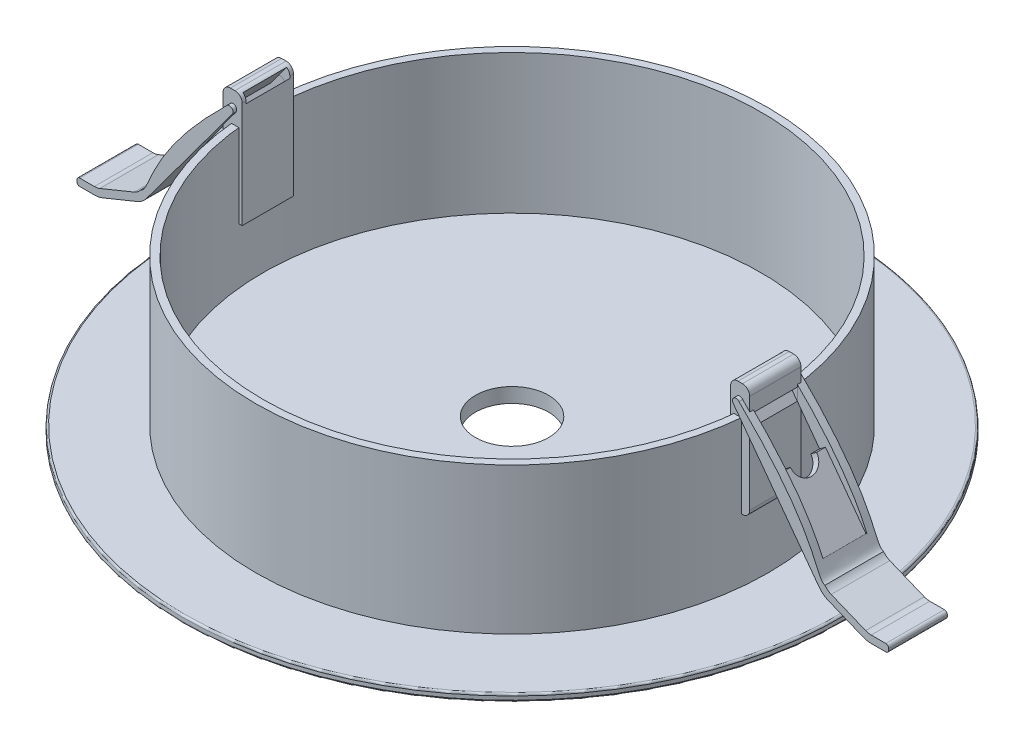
ISO-10303-21;
HEADER;
FILE_DESCRIPTION(('STEP AP214'),'2;1');
FILE_NAME('part.step','',(''),(''),'','','');
FILE_SCHEMA(('AUTOMOTIVE_DESIGN { 1 0 10303 214 1 1 1 1 }'));
ENDSEC;
DATA;
#1=APPLICATION_CONTEXT('core data for automotive mechanical design processes');
#2=APPLICATION_PROTOCOL_DEFINITION('international standard','automotive_design',2000,#1);
#3=PRODUCT_CONTEXT('',#1,'mechanical');
#4=PRODUCT('Part','Part','',(#3));
#5=PRODUCT_RELATED_PRODUCT_CATEGORY('part','',(#4));
#6=PRODUCT_DEFINITION_FORMATION('','',#4);
#7=PRODUCT_DEFINITION_CONTEXT('part definition',#1,'design');
#8=PRODUCT_DEFINITION('design','',#6,#7);
#9=PRODUCT_DEFINITION_SHAPE('','',#8);
#10=(LENGTH_UNIT() NAMED_UNIT(*) SI_UNIT(.MILLI.,.METRE.));
#11=(NAMED_UNIT(*) PLANE_ANGLE_UNIT() SI_UNIT($,.RADIAN.));
#12=(NAMED_UNIT(*) SI_UNIT($,.STERADIAN.) SOLID_ANGLE_UNIT());
#13=UNCERTAINTY_MEASURE_WITH_UNIT(LENGTH_MEASURE(1.E-05),#10,'distance_accuracy_value','');
#14=(GEOMETRIC_REPRESENTATION_CONTEXT(3) GLOBAL_UNCERTAINTY_ASSIGNED_CONTEXT((#13)) GLOBAL_UNIT_ASSIGNED_CONTEXT((#10,
#11,#12)) REPRESENTATION_CONTEXT('',''));
#15=CARTESIAN_POINT('',(0.,0.,0.));
#16=DIRECTION('',(0.,0.,1.));
#17=DIRECTION('',(1.,0.,0.));
#18=AXIS2_PLACEMENT_3D('',#15,#16,#17);
#19=CARTESIAN_POINT('',(34.5925309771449,22.9468725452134,4.));
#20=DIRECTION('',(0.,0.,-1.));
#21=DIRECTION('',(1.,0.,0.));
#22=AXIS2_PLACEMENT_3D('',#19,#20,#21);
#23=CYLINDRICAL_SURFACE('',#22,0.500000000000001);
#24=DIRECTION('',(0.,0.,-1.));
#25=VECTOR('',#24,1.);
#26=CARTESIAN_POINT('',(34.9943450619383,23.2444384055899,4.));
#27=LINE('',#26,#25);
#28=CARTESIAN_POINT('',(34.9943450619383,23.2444384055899,-3.));
#29=VERTEX_POINT('',#28);
#30=CARTESIAN_POINT('',(34.9943450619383,23.2444384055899,-4.));
#31=VERTEX_POINT('',#30);
#32=EDGE_CURVE('E62',#29,#31,#27,.T.);
#33=ORIENTED_EDGE('',*,*,#32,.T.);
#34=CARTESIAN_POINT('',(34.5925309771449,22.9468725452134,-4.));
#35=DIRECTION('',(0.,0.,-1.));
#36=DIRECTION('',(-1.,0.,0.));
#37=AXIS2_PLACEMENT_3D('',#34,#35,#36);
#38=CIRCLE('',#37,0.500000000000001);
#39=CARTESIAN_POINT('',(34.1907168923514,22.6493066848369,-4.));
#40=VERTEX_POINT('',#39);
#41=EDGE_CURVE('E201',#40,#31,#38,.T.);
#42=ORIENTED_EDGE('',*,*,#41,.F.);
#43=DIRECTION('',(0.,0.,-1.));
#44=VECTOR('',#43,1.);
#45=CARTESIAN_POINT('',(34.1907168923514,22.6493066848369,4.));
#46=LINE('',#45,#44);
#47=CARTESIAN_POINT('',(34.1907168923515,22.6493066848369,-3.));
#48=VERTEX_POINT('',#47);
#49=EDGE_CURVE('E200',#48,#40,#46,.T.);
#50=ORIENTED_EDGE('',*,*,#49,.F.);
#51=CARTESIAN_POINT('',(34.5925309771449,22.9468725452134,-3.));
#52=DIRECTION('',(0.,0.,1.));
#53=DIRECTION('',(1.,0.,0.));
#54=AXIS2_PLACEMENT_3D('',#51,#52,#53);
#55=CIRCLE('',#54,0.500000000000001);
#56=EDGE_CURVE('E283',#29,#48,#55,.T.);
#57=ORIENTED_EDGE('',*,*,#56,.F.);
#58=EDGE_LOOP('',(#33,#42,#50,#57));
#59=FACE_BOUND('',#58,.T.);
#60=ADVANCED_FACE('F54',(#59),#23,.T.);
#61=CARTESIAN_POINT('',(34.9943450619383,23.2444384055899,4.));
#62=CARTESIAN_POINT('',(45.9573463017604,12.5997411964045,4.));
#63=CARTESIAN_POINT('',(45.2142635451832,7.96692643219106,4.));
#64=CARTESIAN_POINT('',(46.7276162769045,7.40057234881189,4.));
#65=B_SPLINE_CURVE_WITH_KNOTS('',3,(#61,#62,#63,#64),.UNSPECIFIED.,.F.,.F.,(4,4),(0.,1.),.UNSPECIFIED.);
#66=DIRECTION('',(0.,0.,-1.));
#67=VECTOR('',#66,1.);
#68=SURFACE_OF_LINEAR_EXTRUSION('',#65,#67);
#69=CARTESIAN_POINT('',(34.9943450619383,23.2444384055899,-3.));
#70=CARTESIAN_POINT('',(35.3388225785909,22.909934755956,-3.));
#71=CARTESIAN_POINT('',(35.6806950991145,22.5727271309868,-3.));
#72=CARTESIAN_POINT('',(36.3601321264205,21.8908662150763,-3.));
#73=CARTESIAN_POINT('',(36.6976691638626,21.546185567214,-3.));
#74=CARTESIAN_POINT('',(37.3671710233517,20.8493497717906,-3.));
#75=CARTESIAN_POINT('',(37.6991149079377,20.4971744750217,-3.));
#76=CARTESIAN_POINT('',(38.3560600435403,19.7852336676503,-3.));
#77=CARTESIAN_POINT('',(38.6810478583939,19.4254557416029,-3.));
#78=CARTESIAN_POINT('',(39.3226213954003,18.6981050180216,-3.));
#79=CARTESIAN_POINT('',(39.6392022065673,18.330527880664,-3.));
#80=CARTESIAN_POINT('',(40.2561189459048,17.5947176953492,-3.));
#81=CARTESIAN_POINT('',(40.5566548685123,17.2266526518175,-3.));
#82=CARTESIAN_POINT('',(41.1465586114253,16.4822076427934,-3.));
#83=CARTESIAN_POINT('',(41.4359364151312,16.1058356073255,-3.));
#84=CARTESIAN_POINT('',(42.0016998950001,15.3441464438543,-3.));
#85=CARTESIAN_POINT('',(42.2781012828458,14.9588410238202,-3.));
#86=CARTESIAN_POINT('',(42.8158430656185,14.1784925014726,-3.));
#87=CARTESIAN_POINT('',(43.0772005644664,13.7834612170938,-3.));
#88=CARTESIAN_POINT('',(43.5825475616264,12.9826476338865,-3.));
#89=CARTESIAN_POINT('',(43.826545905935,12.5768709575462,-3.));
#90=CARTESIAN_POINT('',(44.1453744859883,12.016418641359,-3.));
#91=CARTESIAN_POINT('',(44.2288584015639,11.8666298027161,-3.));
#92=CARTESIAN_POINT('',(44.3931348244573,11.5655496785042,-3.));
#93=CARTESIAN_POINT('',(44.4739269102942,11.4142581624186,-3.));
#94=CARTESIAN_POINT('',(44.632748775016,11.110212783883,-3.));
#95=CARTESIAN_POINT('',(44.7107782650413,10.9574587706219,-3.));
#96=CARTESIAN_POINT('',(44.8644111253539,10.6499175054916,-3.));
#97=CARTESIAN_POINT('',(44.9400026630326,10.4951243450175,-3.));
#98=CARTESIAN_POINT('',(45.0885638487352,10.1842975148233,-3.));
#99=CARTESIAN_POINT('',(45.1615336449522,10.0282639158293,-3.));
#100=CARTESIAN_POINT('',(45.2693696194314,9.79349333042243,-3.));
#101=CARTESIAN_POINT('',(45.3050415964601,9.71512447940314,-3.));
#102=CARTESIAN_POINT('',(45.3759724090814,9.55820168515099,-3.));
#103=CARTESIAN_POINT('',(45.4112312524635,9.47964774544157,-3.));
#104=CARTESIAN_POINT('',(45.4463460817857,9.40102987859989,-3.));
#105=B_SPLINE_CURVE_WITH_KNOTS('',3,(#69,#70,#71,#72,#73,#74,#75,#76,#77,#78,#79,#80,#81,#82,
#83,#84,#85,#86,#87,#88,#89,#90,#91,#92,#93,#94,#95,#96,#97,#98,#99,#100,#101,#102,#103,#104),
.UNSPECIFIED.,.F.,.F.,(4,2,2,2,2,2,2,2,2,2,2,2,2,2,2,2,2,4),(0.,1.4404993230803,
2.88770561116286,4.33947732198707,5.79383792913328,7.24903020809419,8.67438327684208,
10.0984299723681,11.5207054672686,12.9413306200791,14.3612265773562,14.8756534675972,
15.390160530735,15.9047212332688,16.4214874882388,16.9382244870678,17.1965402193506,
17.4548510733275),.UNSPECIFIED.);
#106=CARTESIAN_POINT('',(45.4463460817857,9.40102987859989,-3.));
#107=VERTEX_POINT('',#106);
#108=EDGE_CURVE('E289',#29,#107,#105,.T.);
#109=ORIENTED_EDGE('',*,*,#108,.T.);
#110=DIRECTION('',(0.,0.,-1.));
#111=VECTOR('',#110,1.);
#112=CARTESIAN_POINT('',(45.4463460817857,9.40102987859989,3.));
#113=LINE('',#112,#111);
#114=CARTESIAN_POINT('',(45.4463460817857,9.40102987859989,3.));
#115=VERTEX_POINT('',#114);
#116=EDGE_CURVE('E325',#115,#107,#113,.T.);
#117=ORIENTED_EDGE('',*,*,#116,.F.);
#118=CARTESIAN_POINT('',(34.9943450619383,23.2444384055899,3.));
#119=CARTESIAN_POINT('',(35.3388225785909,22.909934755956,3.));
#120=CARTESIAN_POINT('',(35.6806950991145,22.5727271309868,3.));
#121=CARTESIAN_POINT('',(36.3601321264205,21.8908662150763,3.));
#122=CARTESIAN_POINT('',(36.6976691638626,21.546185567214,3.));
#123=CARTESIAN_POINT('',(37.3671710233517,20.8493497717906,3.));
#124=CARTESIAN_POINT('',(37.6991149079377,20.4971744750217,3.));
#125=CARTESIAN_POINT('',(38.3560600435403,19.7852336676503,3.));
#126=CARTESIAN_POINT('',(38.6810478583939,19.4254557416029,3.));
#127=CARTESIAN_POINT('',(39.3226213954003,18.6981050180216,3.));
#128=CARTESIAN_POINT('',(39.6392022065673,18.330527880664,3.));
#129=CARTESIAN_POINT('',(40.2561189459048,17.5947176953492,3.));
#130=CARTESIAN_POINT('',(40.5566548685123,17.2266526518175,3.));
#131=CARTESIAN_POINT('',(41.1465586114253,16.4822076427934,3.));
#132=CARTESIAN_POINT('',(41.4359364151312,16.1058356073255,3.));
#133=CARTESIAN_POINT('',(42.0016998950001,15.3441464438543,3.));
#134=CARTESIAN_POINT('',(42.2781012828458,14.9588410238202,3.));
#135=CARTESIAN_POINT('',(42.8158430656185,14.1784925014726,3.));
#136=CARTESIAN_POINT('',(43.0772005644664,13.7834612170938,3.));
#137=CARTESIAN_POINT('',(43.5825475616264,12.9826476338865,3.));
#138=CARTESIAN_POINT('',(43.826545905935,12.5768709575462,3.));
#139=CARTESIAN_POINT('',(44.1453744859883,12.016418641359,3.));
#140=CARTESIAN_POINT('',(44.2288584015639,11.8666298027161,3.));
#141=CARTESIAN_POINT('',(44.3931348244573,11.5655496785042,3.));
#142=CARTESIAN_POINT('',(44.4739269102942,11.4142581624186,3.));
#143=CARTESIAN_POINT('',(44.632748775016,11.110212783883,3.));
#144=CARTESIAN_POINT('',(44.7107782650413,10.9574587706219,3.));
#145=CARTESIAN_POINT('',(44.8644111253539,10.6499175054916,3.));
#146=CARTESIAN_POINT('',(44.9400026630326,10.4951243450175,3.));
#147=CARTESIAN_POINT('',(45.0885638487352,10.1842975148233,3.));
#148=CARTESIAN_POINT('',(45.1615336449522,10.0282639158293,3.));
#149=CARTESIAN_POINT('',(45.2693696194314,9.79349333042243,3.));
#150=CARTESIAN_POINT('',(45.3050415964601,9.71512447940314,3.));
#151=CARTESIAN_POINT('',(45.3759724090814,9.55820168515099,3.));
#152=CARTESIAN_POINT('',(45.4112312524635,9.47964774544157,3.));
#153=CARTESIAN_POINT('',(45.4463460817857,9.40102987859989,3.));
#154=B_SPLINE_CURVE_WITH_KNOTS('',3,(#118,#119,#120,#121,#122,#123,#124,#125,#126,#127,#128,
#129,#130,#131,#132,#133,#134,#135,#136,#137,#138,#139,#140,#141,#142,#143,#144,#145,#146,#147,
#148,#149,#150,#151,#152,#153),.UNSPECIFIED.,.F.,.F.,(4,2,2,2,2,2,2,2,2,2,2,2,2,2,2,2,2,4),(0.,
1.4404993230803,2.88770561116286,4.33947732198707,5.79383792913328,7.24903020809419,
8.67438327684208,10.0984299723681,11.5207054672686,12.9413306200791,14.3612265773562,
14.8756534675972,15.390160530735,15.9047212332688,16.4214874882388,16.9382244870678,
17.1965402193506,17.4548510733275),.UNSPECIFIED.);
#155=CARTESIAN_POINT('',(34.9943450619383,23.2444384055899,3.));
#156=VERTEX_POINT('',#155);
#157=EDGE_CURVE('E316',#156,#115,#154,.T.);
#158=ORIENTED_EDGE('',*,*,#157,.F.);
#159=CARTESIAN_POINT('',(34.9943450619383,23.2444384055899,4.));
#160=VERTEX_POINT('',#159);
#161=EDGE_CURVE('E12',#160,#156,#27,.T.);
#162=ORIENTED_EDGE('',*,*,#161,.F.);
#163=CARTESIAN_POINT('',(46.7276162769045,7.40057234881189,4.));
#164=VERTEX_POINT('',#163);
#165=EDGE_CURVE('E415',#160,#164,#65,.T.);
#166=ORIENTED_EDGE('',*,*,#165,.T.);
#167=DIRECTION('',(0.,0.,-1.));
#168=VECTOR('',#167,1.);
#169=CARTESIAN_POINT('',(46.7276162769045,7.40057234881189,4.));
#170=LINE('',#169,#168);
#171=CARTESIAN_POINT('',(46.7276162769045,7.40057234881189,-4.));
#172=VERTEX_POINT('',#171);
#173=EDGE_CURVE('E270',#164,#172,#170,.T.);
#174=ORIENTED_EDGE('',*,*,#173,.T.);
#175=CARTESIAN_POINT('',(34.9943450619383,23.2444384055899,-4.));
#176=CARTESIAN_POINT('',(45.9573463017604,12.5997411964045,-4.));
#177=CARTESIAN_POINT('',(45.2142635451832,7.96692643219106,-4.));
#178=CARTESIAN_POINT('',(46.7276162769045,7.40057234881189,-4.));
#179=B_SPLINE_CURVE_WITH_KNOTS('',3,(#175,#176,#177,#178),.UNSPECIFIED.,.F.,.F.,(4,4),(0.,1.),.UNSPECIFIED.);
#180=EDGE_CURVE('E203',#31,#172,#179,.T.);
#181=ORIENTED_EDGE('',*,*,#180,.F.);
#182=ORIENTED_EDGE('',*,*,#32,.F.);
#183=EDGE_LOOP('',(#109,#117,#158,#162,#166,#174,#181,#182));
#184=FACE_BOUND('',#183,.T.);
#185=ADVANCED_FACE('F285',(#184),#68,.T.);
#186=CARTESIAN_POINT('',(34.1907168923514,22.6493066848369,4.));
#187=VERTEX_POINT('',#186);
#188=CARTESIAN_POINT('',(34.1907168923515,22.6493066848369,2.9851983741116));
#189=VERTEX_POINT('',#188);
#190=EDGE_CURVE('E243',#187,#189,#46,.T.);
#191=ORIENTED_EDGE('',*,*,#190,.F.);
#192=CARTESIAN_POINT('',(34.5925309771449,22.9468725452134,4.));
#193=DIRECTION('',(0.,0.,-1.));
#194=DIRECTION('',(-1.,0.,0.));
#195=AXIS2_PLACEMENT_3D('',#192,#193,#194);
#196=CIRCLE('',#195,0.500000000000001);
#197=EDGE_CURVE('E136',#187,#160,#196,.T.);
#198=ORIENTED_EDGE('',*,*,#197,.T.);
#199=ORIENTED_EDGE('',*,*,#161,.T.);
#200=DIRECTION('',(0.,0.,-1.));
#201=VECTOR('',#200,1.);
#202=CARTESIAN_POINT('',(34.9943450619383,23.2444384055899,3.));
#203=LINE('',#202,#201);
#204=CARTESIAN_POINT('',(34.9943450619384,23.2444384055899,2.9851983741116));
#205=VERTEX_POINT('',#204);
#206=EDGE_CURVE('E322',#156,#205,#203,.T.);
#207=ORIENTED_EDGE('',*,*,#206,.T.);
#208=CARTESIAN_POINT('',(34.5925309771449,22.9468725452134,2.9851983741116));
#209=DIRECTION('',(0.,0.,-1.));
#210=DIRECTION('',(0.,-1.,0.));
#211=AXIS2_PLACEMENT_3D('',#208,#209,#210);
#212=CIRCLE('',#211,0.500000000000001);
#213=EDGE_CURVE('E458',#189,#205,#212,.T.);
#214=ORIENTED_EDGE('',*,*,#213,.F.);
#215=EDGE_LOOP('',(#191,#198,#199,#207,#214));
#216=FACE_BOUND('',#215,.T.);
#217=ADVANCED_FACE('F56',(#216),#23,.T.);
#218=CARTESIAN_POINT('',(48.3348726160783,8.59083579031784,4.));
#219=DIRECTION('',(0.,0.,-1.));
#220=DIRECTION('',(1.,0.,0.));
#221=AXIS2_PLACEMENT_3D('',#218,#219,#220);
#222=CYLINDRICAL_SURFACE('',#221,2.);
#223=CARTESIAN_POINT('',(48.3348726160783,8.59083579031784,-4.));
#224=DIRECTION('',(0.,0.,1.));
#225=DIRECTION('',(1.,0.,0.));
#226=AXIS2_PLACEMENT_3D('',#223,#224,#225);
#227=CIRCLE('',#226,2.);
#228=CARTESIAN_POINT('',(47.5779611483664,6.73959700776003,-4.));
#229=VERTEX_POINT('',#228);
#230=EDGE_CURVE('E209',#172,#229,#227,.T.);
#231=ORIENTED_EDGE('',*,*,#230,.F.);
#232=ORIENTED_EDGE('',*,*,#173,.F.);
#233=CARTESIAN_POINT('',(48.3348726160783,8.59083579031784,4.));
#234=DIRECTION('',(0.,0.,1.));
#235=DIRECTION('',(1.,0.,0.));
#236=AXIS2_PLACEMENT_3D('',#233,#234,#235);
#237=CIRCLE('',#236,2.);
#238=CARTESIAN_POINT('',(47.5779611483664,6.73959700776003,4.));
#239=VERTEX_POINT('',#238);
#240=EDGE_CURVE('E420',#164,#239,#237,.T.);
#241=ORIENTED_EDGE('',*,*,#240,.T.);
#242=DIRECTION('',(0.,0.,-1.));
#243=VECTOR('',#242,1.);
#244=CARTESIAN_POINT('',(47.5779611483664,6.73959700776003,4.));
#245=LINE('',#244,#243);
#246=EDGE_CURVE('E268',#239,#229,#245,.T.);
#247=ORIENTED_EDGE('',*,*,#246,.T.);
#248=EDGE_LOOP('',(#231,#232,#241,#247));
#249=FACE_BOUND('',#248,.T.);
#250=ADVANCED_FACE('F409',(#249),#222,.F.);
#251=CARTESIAN_POINT('',(47.5779611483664,6.73959700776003,4.));
#252=DIRECTION('',(-0.37845573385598,-0.925619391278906,0.));
#253=DIRECTION('',(-0.925619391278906,0.37845573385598,0.));
#254=AXIS2_PLACEMENT_3D('',#251,#252,#253);
#255=PLANE('',#254);
#256=DIRECTION('',(0.925619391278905,-0.37845573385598,0.));
#257=VECTOR('',#256,1.);
#258=CARTESIAN_POINT('',(47.5779611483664,6.73959700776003,-4.));
#259=LINE('',#258,#257);
#260=CARTESIAN_POINT('',(52.2804771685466,4.81689079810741,-4.));
#261=VERTEX_POINT('',#260);
#262=EDGE_CURVE('E215',#229,#261,#259,.T.);
#263=ORIENTED_EDGE('',*,*,#262,.F.);
#264=ORIENTED_EDGE('',*,*,#246,.F.);
#265=DIRECTION('',(0.925619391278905,-0.37845573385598,0.));
#266=VECTOR('',#265,1.);
#267=CARTESIAN_POINT('',(47.5779611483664,6.73959700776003,4.));
#268=LINE('',#267,#266);
#269=CARTESIAN_POINT('',(52.2804771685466,4.81689079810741,4.));
#270=VERTEX_POINT('',#269);
#271=EDGE_CURVE('E426',#239,#270,#268,.T.);
#272=ORIENTED_EDGE('',*,*,#271,.T.);
#273=DIRECTION('',(0.,0.,-1.));
#274=VECTOR('',#273,1.);
#275=CARTESIAN_POINT('',(52.2804771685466,4.81689079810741,4.));
#276=LINE('',#275,#274);
#277=EDGE_CURVE('E265',#270,#261,#276,.T.);
#278=ORIENTED_EDGE('',*,*,#277,.T.);
#279=EDGE_LOOP('',(#263,#264,#272,#278));
#280=FACE_BOUND('',#279,.T.);
#281=ADVANCED_FACE('F405',(#280),#255,.F.);
#282=CARTESIAN_POINT('',(53.0373886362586,6.66812958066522,4.));
#283=DIRECTION('',(0.,0.,-1.));
#284=DIRECTION('',(1.,0.,0.));
#285=AXIS2_PLACEMENT_3D('',#282,#283,#284);
#286=CYLINDRICAL_SURFACE('',#285,2.);
#287=CARTESIAN_POINT('',(53.0373886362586,6.66812958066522,-4.));
#288=DIRECTION('',(0.,0.,1.));
#289=DIRECTION('',(1.,0.,0.));
#290=AXIS2_PLACEMENT_3D('',#287,#288,#289);
#291=CIRCLE('',#290,2.);
#292=CARTESIAN_POINT('',(53.0373886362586,4.66812958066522,-4.));
#293=VERTEX_POINT('',#292);
#294=EDGE_CURVE('E218',#261,#293,#291,.T.);
#295=ORIENTED_EDGE('',*,*,#294,.F.);
#296=ORIENTED_EDGE('',*,*,#277,.F.);
#297=CARTESIAN_POINT('',(53.0373886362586,6.66812958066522,4.));
#298=DIRECTION('',(0.,0.,1.));
#299=DIRECTION('',(1.,0.,0.));
#300=AXIS2_PLACEMENT_3D('',#297,#298,#299);
#301=CIRCLE('',#300,2.);
#302=CARTESIAN_POINT('',(53.0373886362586,4.66812958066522,4.));
#303=VERTEX_POINT('',#302);
#304=EDGE_CURVE('E429',#270,#303,#301,.T.);
#305=ORIENTED_EDGE('',*,*,#304,.T.);
#306=DIRECTION('',(0.,0.,-1.));
#307=VECTOR('',#306,1.);
#308=CARTESIAN_POINT('',(53.0373886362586,4.66812958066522,4.));
#309=LINE('',#308,#307);
#310=EDGE_CURVE('E262',#303,#293,#309,.T.);
#311=ORIENTED_EDGE('',*,*,#310,.T.);
#312=EDGE_LOOP('',(#295,#296,#305,#311));
#313=FACE_BOUND('',#312,.T.);
#314=ADVANCED_FACE('F401',(#313),#286,.F.);
#315=CARTESIAN_POINT('',(53.0373886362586,4.66812958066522,4.));
#316=DIRECTION('',(0.,-1.,0.));
#317=DIRECTION('',(-1.,0.,0.));
#318=AXIS2_PLACEMENT_3D('',#315,#316,#317);
#319=PLANE('',#318);
#320=DIRECTION('',(1.,0.,0.));
#321=VECTOR('',#320,1.);
#322=CARTESIAN_POINT('',(53.0373886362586,4.66812958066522,-4.));
#323=LINE('',#322,#321);
#324=CARTESIAN_POINT('',(55.0301334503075,4.66812958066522,-4.));
#325=VERTEX_POINT('',#324);
#326=EDGE_CURVE('E221',#293,#325,#323,.T.);
#327=ORIENTED_EDGE('',*,*,#326,.F.);
#328=ORIENTED_EDGE('',*,*,#310,.F.);
#329=DIRECTION('',(1.,0.,0.));
#330=VECTOR('',#329,1.);
#331=CARTESIAN_POINT('',(53.0373886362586,4.66812958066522,4.));
#332=LINE('',#331,#330);
#333=CARTESIAN_POINT('',(55.0301334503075,4.66812958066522,4.));
#334=VERTEX_POINT('',#333);
#335=EDGE_CURVE('E432',#303,#334,#332,.T.);
#336=ORIENTED_EDGE('',*,*,#335,.T.);
#337=DIRECTION('',(0.,0.,-1.));
#338=VECTOR('',#337,1.);
#339=CARTESIAN_POINT('',(55.0301334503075,4.66812958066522,4.));
#340=LINE('',#339,#338);
#341=EDGE_CURVE('E259',#334,#325,#340,.T.);
#342=ORIENTED_EDGE('',*,*,#341,.T.);
#343=EDGE_LOOP('',(#327,#328,#336,#342));
#344=FACE_BOUND('',#343,.T.);
#345=ADVANCED_FACE('F397',(#344),#319,.F.);
#346=CARTESIAN_POINT('',(55.0301334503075,4.26812958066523,4.));
#347=DIRECTION('',(0.,0.,-1.));
#348=DIRECTION('',(1.,0.,0.));
#349=AXIS2_PLACEMENT_3D('',#346,#347,#348);
#350=CYLINDRICAL_SURFACE('',#349,0.399999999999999);
#351=CARTESIAN_POINT('',(55.0301334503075,4.26812958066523,-4.));
#352=DIRECTION('',(0.,0.,-1.));
#353=DIRECTION('',(-1.,0.,0.));
#354=AXIS2_PLACEMENT_3D('',#351,#352,#353);
#355=CIRCLE('',#354,0.399999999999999);
#356=CARTESIAN_POINT('',(55.4301334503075,4.26812958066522,-4.));
#357=VERTEX_POINT('',#356);
#358=EDGE_CURVE('E224',#325,#357,#355,.T.);
#359=ORIENTED_EDGE('',*,*,#358,.F.);
#360=ORIENTED_EDGE('',*,*,#341,.F.);
#361=CARTESIAN_POINT('',(55.0301334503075,4.26812958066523,4.));
#362=DIRECTION('',(0.,0.,-1.));
#363=DIRECTION('',(-1.,0.,0.));
#364=AXIS2_PLACEMENT_3D('',#361,#362,#363);
#365=CIRCLE('',#364,0.399999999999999);
#366=CARTESIAN_POINT('',(55.4301334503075,4.26812958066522,4.));
#367=VERTEX_POINT('',#366);
#368=EDGE_CURVE('E435',#334,#367,#365,.T.);
#369=ORIENTED_EDGE('',*,*,#368,.T.);
#370=DIRECTION('',(0.,0.,-1.));
#371=VECTOR('',#370,1.);
#372=CARTESIAN_POINT('',(55.4301334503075,4.26812958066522,4.));
#373=LINE('',#372,#371);
#374=EDGE_CURVE('E256',#367,#357,#373,.T.);
#375=ORIENTED_EDGE('',*,*,#374,.T.);
#376=EDGE_LOOP('',(#359,#360,#369,#375));
#377=FACE_BOUND('',#376,.T.);
#378=ADVANCED_FACE('F393',(#377),#350,.T.);
#379=CARTESIAN_POINT('',(55.4301334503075,4.26812958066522,4.));
#380=DIRECTION('',(-1.,0.,0.));
#381=DIRECTION('',(0.,0.,-1.));
#382=AXIS2_PLACEMENT_3D('',#379,#380,#381);
#383=PLANE('',#382);
#384=DIRECTION('',(0.,-1.,0.));
#385=VECTOR('',#384,1.);
#386=CARTESIAN_POINT('',(55.4301334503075,4.26812958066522,-4.));
#387=LINE('',#386,#385);
#388=CARTESIAN_POINT('',(55.4301334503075,4.06812958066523,-4.));
#389=VERTEX_POINT('',#388);
#390=EDGE_CURVE('E227',#357,#389,#387,.T.);
#391=ORIENTED_EDGE('',*,*,#390,.F.);
#392=ORIENTED_EDGE('',*,*,#374,.F.);
#393=DIRECTION('',(0.,-1.,0.));
#394=VECTOR('',#393,1.);
#395=CARTESIAN_POINT('',(55.4301334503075,4.26812958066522,4.));
#396=LINE('',#395,#394);
#397=CARTESIAN_POINT('',(55.4301334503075,4.06812958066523,4.));
#398=VERTEX_POINT('',#397);
#399=EDGE_CURVE('E438',#367,#398,#396,.T.);
#400=ORIENTED_EDGE('',*,*,#399,.T.);
#401=DIRECTION('',(0.,0.,-1.));
#402=VECTOR('',#401,1.);
#403=CARTESIAN_POINT('',(55.4301334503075,4.06812958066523,4.));
#404=LINE('',#403,#402);
#405=EDGE_CURVE('E253',#398,#389,#404,.T.);
#406=ORIENTED_EDGE('',*,*,#405,.T.);
#407=EDGE_LOOP('',(#391,#392,#400,#406));
#408=FACE_BOUND('',#407,.T.);
#409=ADVANCED_FACE('F389',(#408),#383,.F.);
#410=CARTESIAN_POINT('',(55.0301334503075,4.06812958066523,4.));
#411=DIRECTION('',(0.,0.,-1.));
#412=DIRECTION('',(1.,0.,0.));
#413=AXIS2_PLACEMENT_3D('',#410,#411,#412);
#414=CYLINDRICAL_SURFACE('',#413,0.399999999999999);
#415=CARTESIAN_POINT('',(55.0301334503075,4.06812958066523,-4.));
#416=DIRECTION('',(0.,0.,-1.));
#417=DIRECTION('',(1.,0.,0.));
#418=AXIS2_PLACEMENT_3D('',#415,#416,#417);
#419=CIRCLE('',#418,0.399999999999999);
#420=CARTESIAN_POINT('',(55.0301334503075,3.66812958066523,-4.));
#421=VERTEX_POINT('',#420);
#422=EDGE_CURVE('E230',#389,#421,#419,.T.);
#423=ORIENTED_EDGE('',*,*,#422,.F.);
#424=ORIENTED_EDGE('',*,*,#405,.F.);
#425=CARTESIAN_POINT('',(55.0301334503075,4.06812958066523,4.));
#426=DIRECTION('',(0.,0.,-1.));
#427=DIRECTION('',(1.,0.,0.));
#428=AXIS2_PLACEMENT_3D('',#425,#426,#427);
#429=CIRCLE('',#428,0.399999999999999);
#430=CARTESIAN_POINT('',(55.0301334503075,3.66812958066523,4.));
#431=VERTEX_POINT('',#430);
#432=EDGE_CURVE('E441',#398,#431,#429,.T.);
#433=ORIENTED_EDGE('',*,*,#432,.T.);
#434=DIRECTION('',(0.,0.,-1.));
#435=VECTOR('',#434,1.);
#436=CARTESIAN_POINT('',(55.0301334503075,3.66812958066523,4.));
#437=LINE('',#436,#435);
#438=EDGE_CURVE('E250',#431,#421,#437,.T.);
#439=ORIENTED_EDGE('',*,*,#438,.T.);
#440=EDGE_LOOP('',(#423,#424,#433,#439));
#441=FACE_BOUND('',#440,.T.);
#442=ADVANCED_FACE('F385',(#441),#414,.T.);
#443=CARTESIAN_POINT('',(53.0373886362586,3.66812958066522,4.));
#444=DIRECTION('',(0.,1.,0.));
#445=DIRECTION('',(1.,0.,0.));
#446=AXIS2_PLACEMENT_3D('',#443,#444,#445);
#447=PLANE('',#446);
#448=DIRECTION('',(-1.,0.,0.));
#449=VECTOR('',#448,1.);
#450=CARTESIAN_POINT('',(53.0373886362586,3.66812958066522,-4.));
#451=LINE('',#450,#449);
#452=CARTESIAN_POINT('',(53.0373886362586,3.66812958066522,-4.));
#453=VERTEX_POINT('',#452);
#454=EDGE_CURVE('E233',#421,#453,#451,.T.);
#455=ORIENTED_EDGE('',*,*,#454,.F.);
#456=ORIENTED_EDGE('',*,*,#438,.F.);
#457=DIRECTION('',(-1.,0.,0.));
#458=VECTOR('',#457,1.);
#459=CARTESIAN_POINT('',(53.0373886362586,3.66812958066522,4.));
#460=LINE('',#459,#458);
#461=CARTESIAN_POINT('',(53.0373886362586,3.66812958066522,4.));
#462=VERTEX_POINT('',#461);
#463=EDGE_CURVE('E195',#431,#462,#460,.T.);
#464=ORIENTED_EDGE('',*,*,#463,.T.);
#465=DIRECTION('',(0.,0.,-1.));
#466=VECTOR('',#465,1.);
#467=CARTESIAN_POINT('',(53.0373886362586,3.66812958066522,4.));
#468=LINE('',#467,#466);
#469=EDGE_CURVE('E247',#462,#453,#468,.T.);
#470=ORIENTED_EDGE('',*,*,#469,.T.);
#471=EDGE_LOOP('',(#455,#456,#464,#470));
#472=FACE_BOUND('',#471,.T.);
#473=ADVANCED_FACE('F381',(#472),#447,.F.);
#474=CARTESIAN_POINT('',(53.0373886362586,6.66812958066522,4.));
#475=DIRECTION('',(0.,0.,-1.));
#476=DIRECTION('',(1.,0.,0.));
#477=AXIS2_PLACEMENT_3D('',#474,#475,#476);
#478=CYLINDRICAL_SURFACE('',#477,3.);
#479=CARTESIAN_POINT('',(53.0373886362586,6.66812958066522,-4.));
#480=DIRECTION('',(0.,0.,-1.));
#481=DIRECTION('',(1.,0.,0.));
#482=AXIS2_PLACEMENT_3D('',#479,#480,#481);
#483=CIRCLE('',#482,3.);
#484=CARTESIAN_POINT('',(51.9020214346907,3.89127140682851,-4.));
#485=VERTEX_POINT('',#484);
#486=EDGE_CURVE('E236',#453,#485,#483,.T.);
#487=ORIENTED_EDGE('',*,*,#486,.F.);
#488=ORIENTED_EDGE('',*,*,#469,.F.);
#489=CARTESIAN_POINT('',(53.0373886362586,6.66812958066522,4.));
#490=DIRECTION('',(0.,0.,-1.));
#491=DIRECTION('',(1.,0.,0.));
#492=AXIS2_PLACEMENT_3D('',#489,#490,#491);
#493=CIRCLE('',#492,3.);
#494=CARTESIAN_POINT('',(51.9020214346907,3.89127140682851,4.));
#495=VERTEX_POINT('',#494);
#496=EDGE_CURVE('E193',#462,#495,#493,.T.);
#497=ORIENTED_EDGE('',*,*,#496,.T.);
#498=DIRECTION('',(0.,0.,-1.));
#499=VECTOR('',#498,1.);
#500=CARTESIAN_POINT('',(51.9020214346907,3.89127140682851,4.));
#501=LINE('',#500,#499);
#502=EDGE_CURVE('E187',#495,#485,#501,.T.);
#503=ORIENTED_EDGE('',*,*,#502,.T.);
#504=EDGE_LOOP('',(#487,#488,#497,#503));
#505=FACE_BOUND('',#504,.T.);
#506=ADVANCED_FACE('F378',(#505),#478,.T.);
#507=CARTESIAN_POINT('',(47.1995054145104,5.81397761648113,4.));
#508=DIRECTION('',(0.37845573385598,0.925619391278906,0.));
#509=DIRECTION('',(0.925619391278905,-0.37845573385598,0.));
#510=AXIS2_PLACEMENT_3D('',#507,#508,#509);
#511=PLANE('',#510);
#512=DIRECTION('',(-0.925619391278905,0.37845573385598,0.));
#513=VECTOR('',#512,1.);
#514=CARTESIAN_POINT('',(47.1995054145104,5.81397761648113,-4.));
#515=LINE('',#514,#513);
#516=CARTESIAN_POINT('',(47.1995054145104,5.81397761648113,-4.));
#517=VERTEX_POINT('',#516);
#518=EDGE_CURVE('E239',#485,#517,#515,.T.);
#519=ORIENTED_EDGE('',*,*,#518,.F.);
#520=ORIENTED_EDGE('',*,*,#502,.F.);
#521=DIRECTION('',(-0.925619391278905,0.37845573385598,0.));
#522=VECTOR('',#521,1.);
#523=CARTESIAN_POINT('',(47.1995054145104,5.81397761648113,4.));
#524=LINE('',#523,#522);
#525=CARTESIAN_POINT('',(47.1995054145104,5.81397761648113,4.));
#526=VERTEX_POINT('',#525);
#527=EDGE_CURVE('E176',#495,#526,#524,.T.);
#528=ORIENTED_EDGE('',*,*,#527,.T.);
#529=DIRECTION('',(0.,0.,-1.));
#530=VECTOR('',#529,1.);
#531=CARTESIAN_POINT('',(47.1995054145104,5.81397761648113,4.));
#532=LINE('',#531,#530);
#533=EDGE_CURVE('E182',#526,#517,#532,.T.);
#534=ORIENTED_EDGE('',*,*,#533,.T.);
#535=EDGE_LOOP('',(#519,#520,#528,#534));
#536=FACE_BOUND('',#535,.T.);
#537=ADVANCED_FACE('F190',(#536),#511,.F.);
#538=CARTESIAN_POINT('',(48.3348726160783,8.59083579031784,4.));
#539=DIRECTION('',(0.,0.,-1.));
#540=DIRECTION('',(1.,0.,0.));
#541=AXIS2_PLACEMENT_3D('',#538,#539,#540);
#542=CYLINDRICAL_SURFACE('',#541,3.);
#543=CARTESIAN_POINT('',(48.3348726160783,8.59083579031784,-4.));
#544=DIRECTION('',(0.,0.,-1.));
#545=DIRECTION('',(1.,0.,0.));
#546=AXIS2_PLACEMENT_3D('',#543,#544,#545);
#547=CIRCLE('',#546,3.);
#548=CARTESIAN_POINT('',(45.9239881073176,6.80544062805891,-4.));
#549=VERTEX_POINT('',#548);
#550=EDGE_CURVE('E184',#517,#549,#547,.T.);
#551=ORIENTED_EDGE('',*,*,#550,.F.);
#552=ORIENTED_EDGE('',*,*,#533,.F.);
#553=CARTESIAN_POINT('',(48.3348726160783,8.59083579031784,4.));
#554=DIRECTION('',(0.,0.,-1.));
#555=DIRECTION('',(1.,0.,0.));
#556=AXIS2_PLACEMENT_3D('',#553,#554,#555);
#557=CIRCLE('',#556,3.);
#558=CARTESIAN_POINT('',(45.9239881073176,6.80544062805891,4.));
#559=VERTEX_POINT('',#558);
#560=EDGE_CURVE('E172',#526,#559,#557,.T.);
#561=ORIENTED_EDGE('',*,*,#560,.T.);
#562=DIRECTION('',(0.,0.,-1.));
#563=VECTOR('',#562,1.);
#564=CARTESIAN_POINT('',(45.9239881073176,6.80544062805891,4.));
#565=LINE('',#564,#563);
#566=EDGE_CURVE('E188',#559,#549,#565,.T.);
#567=ORIENTED_EDGE('',*,*,#566,.T.);
#568=EDGE_LOOP('',(#551,#552,#561,#567));
#569=FACE_BOUND('',#568,.T.);
#570=ADVANCED_FACE('F183',(#569),#542,.T.);
#571=CARTESIAN_POINT('',(34.1907168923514,22.6493066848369,4.));
#572=DIRECTION('',(0.803628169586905,0.595131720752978,0.));
#573=DIRECTION('',(0.595131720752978,-0.803628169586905,0.));
#574=AXIS2_PLACEMENT_3D('',#571,#572,#573);
#575=PLANE('',#574);
#576=ORIENTED_EDGE('',*,*,#49,.T.);
#577=DIRECTION('',(-0.595131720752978,0.803628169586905,0.));
#578=VECTOR('',#577,1.);
#579=CARTESIAN_POINT('',(34.1907168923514,22.6493066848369,-4.));
#580=LINE('',#579,#578);
#581=EDGE_CURVE('E129',#549,#40,#580,.T.);
#582=ORIENTED_EDGE('',*,*,#581,.F.);
#583=ORIENTED_EDGE('',*,*,#566,.F.);
#584=DIRECTION('',(-0.595131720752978,0.803628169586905,0.));
#585=VECTOR('',#584,1.);
#586=CARTESIAN_POINT('',(34.1907168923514,22.6493066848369,4.));
#587=LINE('',#586,#585);
#588=EDGE_CURVE('E78',#559,#187,#587,.T.);
#589=ORIENTED_EDGE('',*,*,#588,.T.);
#590=ORIENTED_EDGE('',*,*,#190,.T.);
#591=DIRECTION('',(-0.595131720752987,0.803628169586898,0.));
#592=VECTOR('',#591,1.);
#593=CARTESIAN_POINT('',(32.5272950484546,24.8954861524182,2.9851983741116));
#594=LINE('',#593,#592);
#595=CARTESIAN_POINT('',(38.9927273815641,16.1649759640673,2.9851983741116));
#596=VERTEX_POINT('',#595);
#597=EDGE_CURVE('E463',#596,#189,#594,.T.);
#598=ORIENTED_EDGE('',*,*,#597,.F.);
#599=DIRECTION('',(0.,0.,1.));
#600=VECTOR('',#599,1.);
#601=CARTESIAN_POINT('',(38.9927273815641,16.1649759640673,1.77998688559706));
#602=LINE('',#601,#600);
#603=CARTESIAN_POINT('',(38.9927273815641,16.1649759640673,1.77998688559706));
#604=VERTEX_POINT('',#603);
#605=EDGE_CURVE('E503',#604,#596,#602,.T.);
#606=ORIENTED_EDGE('',*,*,#605,.F.);
#607=CARTESIAN_POINT('',(38.9927273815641,16.1649759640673,-0.00740081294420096));
#608=DIRECTION('',(-0.803628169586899,-0.595131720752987,0.));
#609=DIRECTION('',(0.595131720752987,-0.803628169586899,0.));
#610=AXIS2_PLACEMENT_3D('',#607,#608,#609);
#611=CIRCLE('',#610,1.78738769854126);
#612=CARTESIAN_POINT('',(38.9927273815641,16.1649759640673,-1.79478851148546));
#613=VERTEX_POINT('',#612);
#614=EDGE_CURVE('E501',#613,#604,#611,.T.);
#615=ORIENTED_EDGE('',*,*,#614,.F.);
#616=DIRECTION('',(0.,0.,1.));
#617=VECTOR('',#616,1.);
#618=CARTESIAN_POINT('',(38.9927273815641,16.1649759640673,-3.));
#619=LINE('',#618,#617);
#620=CARTESIAN_POINT('',(38.9927273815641,16.1649759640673,-3.));
#621=VERTEX_POINT('',#620);
#622=EDGE_CURVE('E492',#621,#613,#619,.T.);
#623=ORIENTED_EDGE('',*,*,#622,.F.);
#624=DIRECTION('',(0.595131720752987,-0.803628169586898,0.));
#625=VECTOR('',#624,1.);
#626=CARTESIAN_POINT('',(32.5272950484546,24.8954861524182,-3.));
#627=LINE('',#626,#625);
#628=EDGE_CURVE('E497',#48,#621,#627,.T.);
#629=ORIENTED_EDGE('',*,*,#628,.F.);
#630=EDGE_LOOP('',(#576,#582,#583,#589,#590,#598,#606,#615,#623,#629));
#631=FACE_BOUND('',#630,.T.);
#632=ADVANCED_FACE('F369',(#631),#575,.F.);
#633=CARTESIAN_POINT('',(34.5925309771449,22.9468725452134,4.));
#634=DIRECTION('',(0.,0.,1.));
#635=DIRECTION('',(-1.,0.,0.));
#636=AXIS2_PLACEMENT_3D('',#633,#634,#635);
#637=PLANE('',#636);
#638=ORIENTED_EDGE('',*,*,#197,.F.);
#639=ORIENTED_EDGE('',*,*,#588,.F.);
#640=ORIENTED_EDGE('',*,*,#560,.F.);
#641=ORIENTED_EDGE('',*,*,#527,.F.);
#642=ORIENTED_EDGE('',*,*,#496,.F.);
#643=ORIENTED_EDGE('',*,*,#463,.F.);
#644=ORIENTED_EDGE('',*,*,#432,.F.);
#645=ORIENTED_EDGE('',*,*,#399,.F.);
#646=ORIENTED_EDGE('',*,*,#368,.F.);
#647=ORIENTED_EDGE('',*,*,#335,.F.);
#648=ORIENTED_EDGE('',*,*,#304,.F.);
#649=ORIENTED_EDGE('',*,*,#271,.F.);
#650=ORIENTED_EDGE('',*,*,#240,.F.);
#651=ORIENTED_EDGE('',*,*,#165,.F.);
#652=EDGE_LOOP('',(#638,#639,#640,#641,#642,#643,#644,#645,#646,#647,#648,#649,#650,#651));
#653=FACE_BOUND('',#652,.T.);
#654=ADVANCED_FACE('F174',(#653),#637,.T.);
#655=CARTESIAN_POINT('',(34.5925309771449,22.9468725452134,-4.));
#656=DIRECTION('',(0.,0.,1.));
#657=DIRECTION('',(-1.,0.,0.));
#658=AXIS2_PLACEMENT_3D('',#655,#656,#657);
#659=PLANE('',#658);
#660=ORIENTED_EDGE('',*,*,#41,.T.);
#661=ORIENTED_EDGE('',*,*,#180,.T.);
#662=ORIENTED_EDGE('',*,*,#230,.T.);
#663=ORIENTED_EDGE('',*,*,#262,.T.);
#664=ORIENTED_EDGE('',*,*,#294,.T.);
#665=ORIENTED_EDGE('',*,*,#326,.T.);
#666=ORIENTED_EDGE('',*,*,#358,.T.);
#667=ORIENTED_EDGE('',*,*,#390,.T.);
#668=ORIENTED_EDGE('',*,*,#422,.T.);
#669=ORIENTED_EDGE('',*,*,#454,.T.);
#670=ORIENTED_EDGE('',*,*,#486,.T.);
#671=ORIENTED_EDGE('',*,*,#518,.T.);
#672=ORIENTED_EDGE('',*,*,#550,.T.);
#673=ORIENTED_EDGE('',*,*,#581,.T.);
#674=EDGE_LOOP('',(#660,#661,#662,#663,#664,#665,#666,#667,#668,#669,#670,#671,#672,#673));
#675=FACE_BOUND('',#674,.T.);
#676=ADVANCED_FACE('F364',(#675),#659,.F.);
#677=CARTESIAN_POINT('',(48.3348726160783,8.59083579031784,4.));
#678=DIRECTION('',(0.,0.,-1.));
#679=DIRECTION('',(1.,0.,0.));
#680=AXIS2_PLACEMENT_3D('',#677,#678,#679);
#681=CYLINDRICAL_SURFACE('',#680,3.);
#682=CARTESIAN_POINT('',(48.3348726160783,8.59083579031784,-3.));
#683=DIRECTION('',(0.,0.,-1.));
#684=DIRECTION('',(-1.,0.,0.));
#685=AXIS2_PLACEMENT_3D('',#682,#683,#684);
#686=CIRCLE('',#685,3.);
#687=CARTESIAN_POINT('',(45.3968612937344,9.19753956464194,-3.));
#688=VERTEX_POINT('',#687);
#689=EDGE_CURVE('E308',#107,#688,#686,.F.);
#690=ORIENTED_EDGE('',*,*,#689,.T.);
#691=DIRECTION('',(0.,0.,-1.));
#692=VECTOR('',#691,1.);
#693=CARTESIAN_POINT('',(45.3968612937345,9.19753956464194,4.));
#694=LINE('',#693,#692);
#695=CARTESIAN_POINT('',(45.3968612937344,9.19753956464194,3.));
#696=VERTEX_POINT('',#695);
#697=EDGE_CURVE('E204',#688,#696,#694,.F.);
#698=ORIENTED_EDGE('',*,*,#697,.T.);
#699=CARTESIAN_POINT('',(48.3348726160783,8.59083579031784,3.));
#700=DIRECTION('',(0.,0.,-1.));
#701=DIRECTION('',(-1.,0.,0.));
#702=AXIS2_PLACEMENT_3D('',#699,#700,#701);
#703=CIRCLE('',#702,3.);
#704=EDGE_CURVE('E334',#115,#696,#703,.F.);
#705=ORIENTED_EDGE('',*,*,#704,.F.);
#706=ORIENTED_EDGE('',*,*,#116,.T.);
#707=EDGE_LOOP('',(#690,#698,#705,#706));
#708=FACE_BOUND('',#707,.T.);
#709=ADVANCED_FACE('F324',(#708),#681,.T.);
#710=CARTESIAN_POINT('',(34.9943450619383,23.2444384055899,4.));
#711=DIRECTION('',(0.803628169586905,0.595131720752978,0.));
#712=DIRECTION('',(0.595131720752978,-0.803628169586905,0.));
#713=AXIS2_PLACEMENT_3D('',#710,#711,#712);
#714=PLANE('',#713);
#715=DIRECTION('',(-0.595131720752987,0.803628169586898,0.));
#716=VECTOR('',#715,1.);
#717=CARTESIAN_POINT('',(33.3309232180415,25.4906178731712,2.9851983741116));
#718=LINE('',#717,#716);
#719=CARTESIAN_POINT('',(39.796355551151,16.7601076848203,2.9851983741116));
#720=VERTEX_POINT('',#719);
#721=EDGE_CURVE('E498',#720,#205,#718,.T.);
#722=ORIENTED_EDGE('',*,*,#721,.T.);
#723=ORIENTED_EDGE('',*,*,#206,.F.);
#724=DIRECTION('',(-0.595131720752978,0.803628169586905,0.));
#725=VECTOR('',#724,1.);
#726=CARTESIAN_POINT('',(34.9943450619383,23.2444384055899,3.));
#727=LINE('',#726,#725);
#728=EDGE_CURVE('E69',#696,#156,#727,.T.);
#729=ORIENTED_EDGE('',*,*,#728,.F.);
#730=ORIENTED_EDGE('',*,*,#697,.F.);
#731=DIRECTION('',(-0.595131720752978,0.803628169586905,0.));
#732=VECTOR('',#731,1.);
#733=CARTESIAN_POINT('',(34.9943450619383,23.2444384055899,-3.));
#734=LINE('',#733,#732);
#735=CARTESIAN_POINT('',(39.796355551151,16.7601076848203,-3.));
#736=VERTEX_POINT('',#735);
#737=EDGE_CURVE('E305',#688,#736,#734,.T.);
#738=ORIENTED_EDGE('',*,*,#737,.T.);
#739=DIRECTION('',(0.,0.,1.));
#740=VECTOR('',#739,1.);
#741=CARTESIAN_POINT('',(39.796355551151,16.7601076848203,-3.));
#742=LINE('',#741,#740);
#743=CARTESIAN_POINT('',(39.796355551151,16.7601076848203,-1.79478851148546));
#744=VERTEX_POINT('',#743);
#745=EDGE_CURVE('E494',#736,#744,#742,.T.);
#746=ORIENTED_EDGE('',*,*,#745,.T.);
#747=CARTESIAN_POINT('',(39.796355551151,16.7601076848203,-0.00740081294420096));
#748=DIRECTION('',(-0.803628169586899,-0.595131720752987,0.));
#749=DIRECTION('',(0.595131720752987,-0.803628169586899,0.));
#750=AXIS2_PLACEMENT_3D('',#747,#748,#749);
#751=CIRCLE('',#750,1.78738769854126);
#752=CARTESIAN_POINT('',(39.796355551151,16.7601076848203,1.77998688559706));
#753=VERTEX_POINT('',#752);
#754=EDGE_CURVE('E510',#744,#753,#751,.T.);
#755=ORIENTED_EDGE('',*,*,#754,.T.);
#756=DIRECTION('',(0.,0.,1.));
#757=VECTOR('',#756,1.);
#758=CARTESIAN_POINT('',(39.796355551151,16.7601076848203,1.77998688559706));
#759=LINE('',#758,#757);
#760=EDGE_CURVE('E513',#753,#720,#759,.T.);
#761=ORIENTED_EDGE('',*,*,#760,.T.);
#762=EDGE_LOOP('',(#722,#723,#729,#730,#738,#746,#755,#761));
#763=FACE_BOUND('',#762,.T.);
#764=ADVANCED_FACE('F320',(#763),#714,.T.);
#765=CARTESIAN_POINT('',(34.5925309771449,22.9468725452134,3.));
#766=DIRECTION('',(0.,0.,1.));
#767=DIRECTION('',(-1.,0.,0.));
#768=AXIS2_PLACEMENT_3D('',#765,#766,#767);
#769=PLANE('',#768);
#770=ORIENTED_EDGE('',*,*,#704,.T.);
#771=ORIENTED_EDGE('',*,*,#728,.T.);
#772=ORIENTED_EDGE('',*,*,#157,.T.);
#773=EDGE_LOOP('',(#770,#771,#772));
#774=FACE_BOUND('',#773,.T.);
#775=ADVANCED_FACE('F345',(#774),#769,.F.);
#776=CARTESIAN_POINT('',(34.5925309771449,22.9468725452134,-3.));
#777=DIRECTION('',(0.,0.,1.));
#778=DIRECTION('',(-1.,0.,0.));
#779=AXIS2_PLACEMENT_3D('',#776,#777,#778);
#780=PLANE('',#779);
#781=ORIENTED_EDGE('',*,*,#108,.F.);
#782=ORIENTED_EDGE('',*,*,#56,.T.);
#783=ORIENTED_EDGE('',*,*,#628,.T.);
#784=DIRECTION('',(0.803628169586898,0.595131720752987,0.));
#785=VECTOR('',#784,1.);
#786=CARTESIAN_POINT('',(38.9927273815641,16.1649759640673,-3.));
#787=LINE('',#786,#785);
#788=EDGE_CURVE('E313',#621,#736,#787,.T.);
#789=ORIENTED_EDGE('',*,*,#788,.T.);
#790=ORIENTED_EDGE('',*,*,#737,.F.);
#791=ORIENTED_EDGE('',*,*,#689,.F.);
#792=EDGE_LOOP('',(#781,#782,#783,#789,#790,#791));
#793=FACE_BOUND('',#792,.T.);
#794=ADVANCED_FACE('F306',(#793),#780,.T.);
#795=CARTESIAN_POINT('',(32.5272950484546,24.8954861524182,2.9851983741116));
#796=DIRECTION('',(0.,0.,1.));
#797=DIRECTION('',(0.,-1.,0.));
#798=AXIS2_PLACEMENT_3D('',#795,#796,#797);
#799=PLANE('',#798);
#800=ORIENTED_EDGE('',*,*,#597,.T.);
#801=ORIENTED_EDGE('',*,*,#213,.T.);
#802=ORIENTED_EDGE('',*,*,#721,.F.);
#803=DIRECTION('',(0.803628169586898,0.595131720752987,0.));
#804=VECTOR('',#803,1.);
#805=CARTESIAN_POINT('',(38.9927273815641,16.1649759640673,2.9851983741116));
#806=LINE('',#805,#804);
#807=EDGE_CURVE('E517',#596,#720,#806,.T.);
#808=ORIENTED_EDGE('',*,*,#807,.F.);
#809=EDGE_LOOP('',(#800,#801,#802,#808));
#810=FACE_BOUND('',#809,.T.);
#811=ADVANCED_FACE('F361',(#810),#799,.F.);
#812=CARTESIAN_POINT('',(38.9927273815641,16.1649759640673,1.77998688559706));
#813=DIRECTION('',(0.595131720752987,-0.803628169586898,0.));
#814=DIRECTION('',(-0.803628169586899,-0.595131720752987,0.));
#815=AXIS2_PLACEMENT_3D('',#812,#813,#814);
#816=PLANE('',#815);
#817=ORIENTED_EDGE('',*,*,#760,.F.);
#818=DIRECTION('',(0.803628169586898,0.595131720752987,0.));
#819=VECTOR('',#818,1.);
#820=CARTESIAN_POINT('',(38.9927273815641,16.1649759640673,1.77998688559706));
#821=LINE('',#820,#819);
#822=EDGE_CURVE('E519',#604,#753,#821,.T.);
#823=ORIENTED_EDGE('',*,*,#822,.F.);
#824=ORIENTED_EDGE('',*,*,#605,.T.);
#825=ORIENTED_EDGE('',*,*,#807,.T.);
#826=EDGE_LOOP('',(#817,#823,#824,#825));
#827=FACE_BOUND('',#826,.T.);
#828=ADVANCED_FACE('F526',(#827),#816,.F.);
#829=CARTESIAN_POINT('',(38.9927273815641,16.1649759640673,-0.00740081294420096));
#830=DIRECTION('',(0.803628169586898,0.595131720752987,0.));
#831=DIRECTION('',(0.595131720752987,-0.803628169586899,0.));
#832=AXIS2_PLACEMENT_3D('',#829,#830,#831);
#833=CYLINDRICAL_SURFACE('',#832,1.78738769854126);
#834=ORIENTED_EDGE('',*,*,#754,.F.);
#835=DIRECTION('',(0.803628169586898,0.595131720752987,0.));
#836=VECTOR('',#835,1.);
#837=CARTESIAN_POINT('',(38.9927273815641,16.1649759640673,-1.79478851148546));
#838=LINE('',#837,#836);
#839=EDGE_CURVE('E495',#613,#744,#838,.T.);
#840=ORIENTED_EDGE('',*,*,#839,.F.);
#841=ORIENTED_EDGE('',*,*,#614,.T.);
#842=ORIENTED_EDGE('',*,*,#822,.T.);
#843=EDGE_LOOP('',(#834,#840,#841,#842));
#844=FACE_BOUND('',#843,.T.);
#845=ADVANCED_FACE('F528',(#844),#833,.F.);
#846=CARTESIAN_POINT('',(38.9927273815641,16.1649759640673,-3.));
#847=DIRECTION('',(0.595131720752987,-0.803628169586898,0.));
#848=DIRECTION('',(-0.803628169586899,-0.595131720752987,0.));
#849=AXIS2_PLACEMENT_3D('',#846,#847,#848);
#850=PLANE('',#849);
#851=ORIENTED_EDGE('',*,*,#745,.F.);
#852=ORIENTED_EDGE('',*,*,#788,.F.);
#853=ORIENTED_EDGE('',*,*,#622,.T.);
#854=ORIENTED_EDGE('',*,*,#839,.T.);
#855=EDGE_LOOP('',(#851,#852,#853,#854));
#856=FACE_BOUND('',#855,.T.);
#857=ADVANCED_FACE('F350',(#856),#850,.F.);
#858=CLOSED_SHELL('',(#60,#185,#217,#250,#281,#314,#345,#378,#409,#442,#473,#506,#537,#570,#632,
#654,#676,#709,#764,#775,#794,#811,#828,#845,#857));
#859=MANIFOLD_SOLID_BREP('B2',#858);
#860=CARTESIAN_POINT('',(35.9572334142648,10.6325847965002,3.5));
#861=DIRECTION('',(-1.,0.,0.));
#862=DIRECTION('',(0.,0.,-1.));
#863=AXIS2_PLACEMENT_3D('',#860,#861,#862);
#864=PLANE('',#863);
#865=DIRECTION('',(0.,-1.,0.));
#866=VECTOR('',#865,1.);
#867=CARTESIAN_POINT('',(35.9572334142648,10.6325847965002,-3.5));
#868=LINE('',#867,#866);
#869=CARTESIAN_POINT('',(35.9572334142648,24.1000715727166,-3.5));
#870=VERTEX_POINT('',#869);
#871=CARTESIAN_POINT('',(35.9572334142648,10.6325847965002,-3.5));
#872=VERTEX_POINT('',#871);
#873=EDGE_CURVE('E942',#870,#872,#868,.T.);
#874=ORIENTED_EDGE('',*,*,#873,.F.);
#875=DIRECTION('',(0.,0.,-1.));
#876=VECTOR('',#875,1.);
#877=CARTESIAN_POINT('',(35.9572334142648,24.1000715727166,3.5));
#878=LINE('',#877,#876);
#879=CARTESIAN_POINT('',(35.9572334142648,24.1000715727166,3.5));
#880=VERTEX_POINT('',#879);
#881=EDGE_CURVE('E923',#880,#870,#878,.T.);
#882=ORIENTED_EDGE('',*,*,#881,.F.);
#883=DIRECTION('',(0.,-1.,0.));
#884=VECTOR('',#883,1.);
#885=CARTESIAN_POINT('',(35.9572334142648,10.6325847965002,3.5));
#886=LINE('',#885,#884);
#887=CARTESIAN_POINT('',(35.9572334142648,10.6325847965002,3.5));
#888=VERTEX_POINT('',#887);
#889=EDGE_CURVE('E961',#880,#888,#886,.T.);
#890=ORIENTED_EDGE('',*,*,#889,.T.);
#891=DIRECTION('',(0.,0.,-1.));
#892=VECTOR('',#891,1.);
#893=CARTESIAN_POINT('',(35.9572334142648,10.6325847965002,3.5));
#894=LINE('',#893,#892);
#895=EDGE_CURVE('E926',#888,#872,#894,.T.);
#896=ORIENTED_EDGE('',*,*,#895,.T.);
#897=EDGE_LOOP('',(#874,#882,#890,#896));
#898=FACE_BOUND('',#897,.T.);
#899=DIRECTION('',(0.,0.,1.));
#900=VECTOR('',#899,1.);
#901=CARTESIAN_POINT('',(35.9572334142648,20.2639146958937,3.5));
#902=LINE('',#901,#900);
#903=CARTESIAN_POINT('',(35.9572334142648,20.2639146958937,-3.));
#904=VERTEX_POINT('',#903);
#905=CARTESIAN_POINT('',(35.9572334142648,20.2639146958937,2.9851983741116));
#906=VERTEX_POINT('',#905);
#907=EDGE_CURVE('E52',#904,#906,#902,.T.);
#908=ORIENTED_EDGE('',*,*,#907,.T.);
#909=DIRECTION('',(0.,-1.,0.));
#910=VECTOR('',#909,1.);
#911=CARTESIAN_POINT('',(35.9572334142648,10.6325847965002,2.9851983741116));
#912=LINE('',#911,#910);
#913=CARTESIAN_POINT('',(35.9572334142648,21.9442149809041,2.9851983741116));
#914=VERTEX_POINT('',#913);
#915=EDGE_CURVE('E909',#914,#906,#912,.T.);
#916=ORIENTED_EDGE('',*,*,#915,.F.);
#917=DIRECTION('',(0.,0.,1.));
#918=VECTOR('',#917,1.);
#919=CARTESIAN_POINT('',(35.9572334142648,21.9442149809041,3.5));
#920=LINE('',#919,#918);
#921=CARTESIAN_POINT('',(35.9572334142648,21.9442149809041,-3.));
#922=VERTEX_POINT('',#921);
#923=EDGE_CURVE('E898',#922,#914,#920,.T.);
#924=ORIENTED_EDGE('',*,*,#923,.F.);
#925=DIRECTION('',(0.,1.,0.));
#926=VECTOR('',#925,1.);
#927=CARTESIAN_POINT('',(35.9572334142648,10.6325847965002,-3.));
#928=LINE('',#927,#926);
#929=EDGE_CURVE('E815',#904,#922,#928,.T.);
#930=ORIENTED_EDGE('',*,*,#929,.F.);
#931=EDGE_LOOP('',(#908,#916,#924,#930));
#932=FACE_BOUND('',#931,.T.);
#933=ADVANCED_FACE('F807',(#898,#932),#864,.F.);
#934=CARTESIAN_POINT('',(33.3479864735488,9.63258479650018,3.5));
#935=DIRECTION('',(1.,0.,0.));
#936=DIRECTION('',(0.,0.,1.));
#937=AXIS2_PLACEMENT_3D('',#934,#935,#936);
#938=PLANE('',#937);
#939=DIRECTION('',(0.,0.,-1.));
#940=VECTOR('',#939,1.);
#941=CARTESIAN_POINT('',(33.3479864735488,24.1000715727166,3.5));
#942=LINE('',#941,#940);
#943=CARTESIAN_POINT('',(33.3479864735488,24.1000715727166,-3.));
#944=VERTEX_POINT('',#943);
#945=CARTESIAN_POINT('',(33.3479864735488,24.1000715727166,-3.5));
#946=VERTEX_POINT('',#945);
#947=EDGE_CURVE('E914',#944,#946,#942,.T.);
#948=ORIENTED_EDGE('',*,*,#947,.T.);
#949=DIRECTION('',(0.,1.,0.));
#950=VECTOR('',#949,1.);
#951=CARTESIAN_POINT('',(33.3479864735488,9.63258479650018,-3.5));
#952=LINE('',#951,#950);
#953=CARTESIAN_POINT('',(33.3479864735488,9.63258479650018,-3.5));
#954=VERTEX_POINT('',#953);
#955=EDGE_CURVE('E953',#954,#946,#952,.T.);
#956=ORIENTED_EDGE('',*,*,#955,.F.);
#957=DIRECTION('',(0.,0.,-1.));
#958=VECTOR('',#957,1.);
#959=CARTESIAN_POINT('',(33.3479864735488,9.63258479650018,3.5));
#960=LINE('',#959,#958);
#961=CARTESIAN_POINT('',(33.3479864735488,9.63258479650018,3.5));
#962=VERTEX_POINT('',#961);
#963=EDGE_CURVE('E932',#962,#954,#960,.T.);
#964=ORIENTED_EDGE('',*,*,#963,.F.);
#965=DIRECTION('',(0.,1.,0.));
#966=VECTOR('',#965,1.);
#967=CARTESIAN_POINT('',(33.3479864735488,9.63258479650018,3.5));
#968=LINE('',#967,#966);
#969=CARTESIAN_POINT('',(33.3479864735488,24.1000715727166,3.5));
#970=VERTEX_POINT('',#969);
#971=EDGE_CURVE('E938',#962,#970,#968,.T.);
#972=ORIENTED_EDGE('',*,*,#971,.T.);
#973=CARTESIAN_POINT('',(33.3479864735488,24.1000715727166,2.9851983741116));
#974=VERTEX_POINT('',#973);
#975=EDGE_CURVE('E910',#970,#974,#942,.T.);
#976=ORIENTED_EDGE('',*,*,#975,.T.);
#977=DIRECTION('',(0.,1.,0.));
#978=VECTOR('',#977,1.);
#979=CARTESIAN_POINT('',(33.3479864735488,9.63258479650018,2.9851983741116));
#980=LINE('',#979,#978);
#981=CARTESIAN_POINT('',(33.3479864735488,23.7872764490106,2.9851983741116));
#982=VERTEX_POINT('',#981);
#983=EDGE_CURVE('E977',#982,#974,#980,.T.);
#984=ORIENTED_EDGE('',*,*,#983,.F.);
#985=DIRECTION('',(0.,0.,-1.));
#986=VECTOR('',#985,1.);
#987=CARTESIAN_POINT('',(33.3479864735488,23.7872764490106,3.5));
#988=LINE('',#987,#986);
#989=CARTESIAN_POINT('',(33.3479864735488,23.7872764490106,-3.));
#990=VERTEX_POINT('',#989);
#991=EDGE_CURVE('E982',#982,#990,#988,.T.);
#992=ORIENTED_EDGE('',*,*,#991,.T.);
#993=DIRECTION('',(0.,-1.,0.));
#994=VECTOR('',#993,1.);
#995=CARTESIAN_POINT('',(33.3479864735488,9.63258479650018,-3.));
#996=LINE('',#995,#994);
#997=EDGE_CURVE('E956',#944,#990,#996,.T.);
#998=ORIENTED_EDGE('',*,*,#997,.F.);
#999=EDGE_LOOP('',(#948,#956,#964,#972,#976,#984,#992,#998));
#1000=FACE_BOUND('',#999,.T.);
#1001=ADVANCED_FACE('F809',(#1000),#938,.F.);
#1002=CARTESIAN_POINT('',(34.3479864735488,24.1000715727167,3.5));
#1003=DIRECTION('',(0.,0.,-1.));
#1004=DIRECTION('',(1.,0.,0.));
#1005=AXIS2_PLACEMENT_3D('',#1002,#1003,#1004);
#1006=CYLINDRICAL_SURFACE('',#1005,1.);
#1007=DIRECTION('',(0.,0.,-1.));
#1008=VECTOR('',#1007,1.);
#1009=CARTESIAN_POINT('',(33.7610969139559,24.9097385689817,3.5));
#1010=LINE('',#1009,#1008);
#1011=CARTESIAN_POINT('',(33.7610969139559,24.9097385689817,2.9851983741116));
#1012=VERTEX_POINT('',#1011);
#1013=CARTESIAN_POINT('',(33.7610969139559,24.9097385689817,-3.));
#1014=VERTEX_POINT('',#1013);
#1015=EDGE_CURVE('E901',#1012,#1014,#1010,.T.);
#1016=ORIENTED_EDGE('',*,*,#1015,.F.);
#1017=CARTESIAN_POINT('',(34.3479864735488,24.1000715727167,2.9851983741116));
#1018=DIRECTION('',(0.,0.,-1.));
#1019=DIRECTION('',(0.,-1.,0.));
#1020=AXIS2_PLACEMENT_3D('',#1017,#1018,#1019);
#1021=CIRCLE('',#1020,1.);
#1022=EDGE_CURVE('E980',#974,#1012,#1021,.T.);
#1023=ORIENTED_EDGE('',*,*,#1022,.F.);
#1024=ORIENTED_EDGE('',*,*,#975,.F.);
#1025=CARTESIAN_POINT('',(34.3479864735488,24.1000715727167,3.5));
#1026=DIRECTION('',(0.,0.,-1.));
#1027=DIRECTION('',(1.,0.,0.));
#1028=AXIS2_PLACEMENT_3D('',#1025,#1026,#1027);
#1029=CIRCLE('',#1028,1.);
#1030=CARTESIAN_POINT('',(34.3479864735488,25.1000715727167,3.5));
#1031=VERTEX_POINT('',#1030);
#1032=EDGE_CURVE('E969',#970,#1031,#1029,.T.);
#1033=ORIENTED_EDGE('',*,*,#1032,.T.);
#1034=DIRECTION('',(0.,0.,-1.));
#1035=VECTOR('',#1034,1.);
#1036=CARTESIAN_POINT('',(34.3479864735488,25.1000715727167,3.5));
#1037=LINE('',#1036,#1035);
#1038=CARTESIAN_POINT('',(34.3479864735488,25.1000715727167,-3.5));
#1039=VERTEX_POINT('',#1038);
#1040=EDGE_CURVE('E917',#1031,#1039,#1037,.T.);
#1041=ORIENTED_EDGE('',*,*,#1040,.T.);
#1042=CARTESIAN_POINT('',(34.3479864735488,24.1000715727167,-3.5));
#1043=DIRECTION('',(0.,0.,-1.));
#1044=DIRECTION('',(1.,0.,0.));
#1045=AXIS2_PLACEMENT_3D('',#1042,#1043,#1044);
#1046=CIRCLE('',#1045,1.);
#1047=EDGE_CURVE('E950',#946,#1039,#1046,.T.);
#1048=ORIENTED_EDGE('',*,*,#1047,.F.);
#1049=ORIENTED_EDGE('',*,*,#947,.F.);
#1050=CARTESIAN_POINT('',(34.3479864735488,24.1000715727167,-3.));
#1051=DIRECTION('',(0.,0.,1.));
#1052=DIRECTION('',(1.,0.,0.));
#1053=AXIS2_PLACEMENT_3D('',#1050,#1051,#1052);
#1054=CIRCLE('',#1053,1.);
#1055=EDGE_CURVE('E975',#1014,#944,#1054,.T.);
#1056=ORIENTED_EDGE('',*,*,#1055,.F.);
#1057=EDGE_LOOP('',(#1016,#1023,#1024,#1033,#1041,#1048,#1049,#1056));
#1058=FACE_BOUND('',#1057,.T.);
#1059=ADVANCED_FACE('F1001',(#1058),#1006,.T.);
#1060=CARTESIAN_POINT('',(34.9572334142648,25.1000715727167,3.5));
#1061=DIRECTION('',(0.,-1.,0.));
#1062=DIRECTION('',(0.,0.,-1.));
#1063=AXIS2_PLACEMENT_3D('',#1060,#1061,#1062);
#1064=PLANE('',#1063);
#1065=DIRECTION('',(1.,0.,0.));
#1066=VECTOR('',#1065,1.);
#1067=CARTESIAN_POINT('',(34.9572334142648,25.1000715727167,-3.5));
#1068=LINE('',#1067,#1066);
#1069=CARTESIAN_POINT('',(34.9572334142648,25.1000715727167,-3.5));
#1070=VERTEX_POINT('',#1069);
#1071=EDGE_CURVE('E947',#1039,#1070,#1068,.T.);
#1072=ORIENTED_EDGE('',*,*,#1071,.F.);
#1073=ORIENTED_EDGE('',*,*,#1040,.F.);
#1074=DIRECTION('',(1.,0.,0.));
#1075=VECTOR('',#1074,1.);
#1076=CARTESIAN_POINT('',(34.9572334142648,25.1000715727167,3.5));
#1077=LINE('',#1076,#1075);
#1078=CARTESIAN_POINT('',(34.9572334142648,25.1000715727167,3.5));
#1079=VERTEX_POINT('',#1078);
#1080=EDGE_CURVE('E966',#1031,#1079,#1077,.T.);
#1081=ORIENTED_EDGE('',*,*,#1080,.T.);
#1082=DIRECTION('',(0.,0.,-1.));
#1083=VECTOR('',#1082,1.);
#1084=CARTESIAN_POINT('',(34.9572334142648,25.1000715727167,3.5));
#1085=LINE('',#1084,#1083);
#1086=EDGE_CURVE('E920',#1079,#1070,#1085,.T.);
#1087=ORIENTED_EDGE('',*,*,#1086,.T.);
#1088=EDGE_LOOP('',(#1072,#1073,#1081,#1087));
#1089=FACE_BOUND('',#1088,.T.);
#1090=ADVANCED_FACE('F1015',(#1089),#1064,.F.);
#1091=CARTESIAN_POINT('',(34.9572334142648,24.1000715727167,3.5));
#1092=DIRECTION('',(0.,0.,-1.));
#1093=DIRECTION('',(1.,0.,0.));
#1094=AXIS2_PLACEMENT_3D('',#1091,#1092,#1093);
#1095=CYLINDRICAL_SURFACE('',#1094,1.);
#1096=CARTESIAN_POINT('',(34.9572334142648,24.1000715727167,-3.5));
#1097=DIRECTION('',(0.,0.,-1.));
#1098=DIRECTION('',(1.,0.,0.));
#1099=AXIS2_PLACEMENT_3D('',#1096,#1097,#1098);
#1100=CIRCLE('',#1099,1.);
#1101=EDGE_CURVE('E945',#1070,#870,#1100,.T.);
#1102=ORIENTED_EDGE('',*,*,#1101,.F.);
#1103=ORIENTED_EDGE('',*,*,#1086,.F.);
#1104=CARTESIAN_POINT('',(34.9572334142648,24.1000715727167,3.5));
#1105=DIRECTION('',(0.,0.,-1.));
#1106=DIRECTION('',(1.,0.,0.));
#1107=AXIS2_PLACEMENT_3D('',#1104,#1105,#1106);
#1108=CIRCLE('',#1107,1.);
#1109=EDGE_CURVE('E964',#1079,#880,#1108,.T.);
#1110=ORIENTED_EDGE('',*,*,#1109,.T.);
#1111=ORIENTED_EDGE('',*,*,#881,.T.);
#1112=EDGE_LOOP('',(#1102,#1103,#1110,#1111));
#1113=FACE_BOUND('',#1112,.T.);
#1114=ADVANCED_FACE('F1019',(#1113),#1095,.T.);
#1115=CARTESIAN_POINT('',(34.9572334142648,10.6325847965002,3.5));
#1116=DIRECTION('',(0.,0.,-1.));
#1117=DIRECTION('',(1.,0.,0.));
#1118=AXIS2_PLACEMENT_3D('',#1115,#1116,#1117);
#1119=CYLINDRICAL_SURFACE('',#1118,1.);
#1120=CARTESIAN_POINT('',(34.9572334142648,10.6325847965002,-3.5));
#1121=DIRECTION('',(0.,0.,-1.));
#1122=DIRECTION('',(1.,0.,0.));
#1123=AXIS2_PLACEMENT_3D('',#1120,#1121,#1122);
#1124=CIRCLE('',#1123,1.);
#1125=CARTESIAN_POINT('',(34.9572334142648,9.63258479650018,-3.5));
#1126=VERTEX_POINT('',#1125);
#1127=EDGE_CURVE('E939',#872,#1126,#1124,.T.);
#1128=ORIENTED_EDGE('',*,*,#1127,.F.);
#1129=ORIENTED_EDGE('',*,*,#895,.F.);
#1130=CARTESIAN_POINT('',(34.9572334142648,10.6325847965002,3.5));
#1131=DIRECTION('',(0.,0.,-1.));
#1132=DIRECTION('',(1.,0.,0.));
#1133=AXIS2_PLACEMENT_3D('',#1130,#1131,#1132);
#1134=CIRCLE('',#1133,1.);
#1135=CARTESIAN_POINT('',(34.9572334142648,9.63258479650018,3.5));
#1136=VERTEX_POINT('',#1135);
#1137=EDGE_CURVE('E958',#888,#1136,#1134,.T.);
#1138=ORIENTED_EDGE('',*,*,#1137,.T.);
#1139=DIRECTION('',(0.,0.,-1.));
#1140=VECTOR('',#1139,1.);
#1141=CARTESIAN_POINT('',(34.9572334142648,9.63258479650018,3.5));
#1142=LINE('',#1141,#1140);
#1143=EDGE_CURVE('E929',#1136,#1126,#1142,.T.);
#1144=ORIENTED_EDGE('',*,*,#1143,.T.);
#1145=EDGE_LOOP('',(#1128,#1129,#1138,#1144));
#1146=FACE_BOUND('',#1145,.T.);
#1147=ADVANCED_FACE('F1023',(#1146),#1119,.T.);
#1148=CARTESIAN_POINT('',(34.9572334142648,9.63258479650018,3.5));
#1149=DIRECTION('',(0.,1.,0.));
#1150=DIRECTION('',(0.,0.,1.));
#1151=AXIS2_PLACEMENT_3D('',#1148,#1149,#1150);
#1152=PLANE('',#1151);
#1153=DIRECTION('',(-1.,0.,0.));
#1154=VECTOR('',#1153,1.);
#1155=CARTESIAN_POINT('',(34.9572334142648,9.63258479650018,-3.5));
#1156=LINE('',#1155,#1154);
#1157=EDGE_CURVE('E936',#1126,#954,#1156,.T.);
#1158=ORIENTED_EDGE('',*,*,#1157,.F.);
#1159=ORIENTED_EDGE('',*,*,#1143,.F.);
#1160=DIRECTION('',(-1.,0.,0.));
#1161=VECTOR('',#1160,1.);
#1162=CARTESIAN_POINT('',(34.9572334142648,9.63258479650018,3.5));
#1163=LINE('',#1162,#1161);
#1164=EDGE_CURVE('E935',#1136,#962,#1163,.T.);
#1165=ORIENTED_EDGE('',*,*,#1164,.T.);
#1166=ORIENTED_EDGE('',*,*,#963,.T.);
#1167=EDGE_LOOP('',(#1158,#1159,#1165,#1166));
#1168=FACE_BOUND('',#1167,.T.);
#1169=ADVANCED_FACE('F1008',(#1168),#1152,.F.);
#1170=CARTESIAN_POINT('',(34.3479864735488,24.1000715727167,3.5));
#1171=DIRECTION('',(0.,0.,-1.));
#1172=DIRECTION('',(1.,0.,0.));
#1173=AXIS2_PLACEMENT_3D('',#1170,#1171,#1172);
#1174=PLANE('',#1173);
#1175=ORIENTED_EDGE('',*,*,#971,.F.);
#1176=ORIENTED_EDGE('',*,*,#1164,.F.);
#1177=ORIENTED_EDGE('',*,*,#1137,.F.);
#1178=ORIENTED_EDGE('',*,*,#889,.F.);
#1179=ORIENTED_EDGE('',*,*,#1109,.F.);
#1180=ORIENTED_EDGE('',*,*,#1080,.F.);
#1181=ORIENTED_EDGE('',*,*,#1032,.F.);
#1182=EDGE_LOOP('',(#1175,#1176,#1177,#1178,#1179,#1180,#1181));
#1183=FACE_BOUND('',#1182,.T.);
#1184=ADVANCED_FACE('F1010',(#1183),#1174,.F.);
#1185=CARTESIAN_POINT('',(34.3479864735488,24.1000715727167,-3.5));
#1186=DIRECTION('',(0.,0.,-1.));
#1187=DIRECTION('',(1.,0.,0.));
#1188=AXIS2_PLACEMENT_3D('',#1185,#1186,#1187);
#1189=PLANE('',#1188);
#1190=ORIENTED_EDGE('',*,*,#955,.T.);
#1191=ORIENTED_EDGE('',*,*,#1047,.T.);
#1192=ORIENTED_EDGE('',*,*,#1071,.T.);
#1193=ORIENTED_EDGE('',*,*,#1101,.T.);
#1194=ORIENTED_EDGE('',*,*,#873,.T.);
#1195=ORIENTED_EDGE('',*,*,#1127,.T.);
#1196=ORIENTED_EDGE('',*,*,#1157,.T.);
#1197=EDGE_LOOP('',(#1190,#1191,#1192,#1193,#1194,#1195,#1196));
#1198=FACE_BOUND('',#1197,.T.);
#1199=ADVANCED_FACE('F1005',(#1198),#1189,.T.);
#1200=CARTESIAN_POINT('',(32.5272950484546,24.8954861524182,-3.));
#1201=DIRECTION('',(0.,0.,-1.));
#1202=DIRECTION('',(1.,0.,0.));
#1203=AXIS2_PLACEMENT_3D('',#1200,#1201,#1202);
#1204=PLANE('',#1203);
#1205=ORIENTED_EDGE('',*,*,#1055,.T.);
#1206=ORIENTED_EDGE('',*,*,#997,.T.);
#1207=DIRECTION('',(0.595131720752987,-0.803628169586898,0.));
#1208=VECTOR('',#1207,1.);
#1209=CARTESIAN_POINT('',(32.5272950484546,24.8954861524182,-3.));
#1210=LINE('',#1209,#1208);
#1211=EDGE_CURVE('E906',#990,#904,#1210,.T.);
#1212=ORIENTED_EDGE('',*,*,#1211,.T.);
#1213=ORIENTED_EDGE('',*,*,#929,.T.);
#1214=DIRECTION('',(0.595131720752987,-0.803628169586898,0.));
#1215=VECTOR('',#1214,1.);
#1216=CARTESIAN_POINT('',(33.3309232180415,25.4906178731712,-3.));
#1217=LINE('',#1216,#1215);
#1218=EDGE_CURVE('E822',#1014,#922,#1217,.T.);
#1219=ORIENTED_EDGE('',*,*,#1218,.F.);
#1220=EDGE_LOOP('',(#1205,#1206,#1212,#1213,#1219));
#1221=FACE_BOUND('',#1220,.T.);
#1222=ADVANCED_FACE('F904',(#1221),#1204,.F.);
#1223=CARTESIAN_POINT('',(32.5272950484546,24.8954861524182,2.9851983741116));
#1224=DIRECTION('',(0.,0.,1.));
#1225=DIRECTION('',(0.,-1.,0.));
#1226=AXIS2_PLACEMENT_3D('',#1223,#1224,#1225);
#1227=PLANE('',#1226);
#1228=DIRECTION('',(-0.595131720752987,0.803628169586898,0.));
#1229=VECTOR('',#1228,1.);
#1230=CARTESIAN_POINT('',(32.5272950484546,24.8954861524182,2.9851983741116));
#1231=LINE('',#1230,#1229);
#1232=EDGE_CURVE('E986',#906,#982,#1231,.T.);
#1233=ORIENTED_EDGE('',*,*,#1232,.T.);
#1234=ORIENTED_EDGE('',*,*,#983,.T.);
#1235=ORIENTED_EDGE('',*,*,#1022,.T.);
#1236=DIRECTION('',(-0.595131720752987,0.803628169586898,0.));
#1237=VECTOR('',#1236,1.);
#1238=CARTESIAN_POINT('',(33.3309232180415,25.4906178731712,2.9851983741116));
#1239=LINE('',#1238,#1237);
#1240=EDGE_CURVE('E830',#914,#1012,#1239,.T.);
#1241=ORIENTED_EDGE('',*,*,#1240,.F.);
#1242=ORIENTED_EDGE('',*,*,#915,.T.);
#1243=EDGE_LOOP('',(#1233,#1234,#1235,#1241,#1242));
#1244=FACE_BOUND('',#1243,.T.);
#1245=ADVANCED_FACE('F990',(#1244),#1227,.F.);
#1246=CARTESIAN_POINT('',(38.9927273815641,16.1649759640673,-0.00740081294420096));
#1247=DIRECTION('',(0.803628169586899,0.595131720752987,0.));
#1248=DIRECTION('',(0.595131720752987,-0.803628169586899,0.));
#1249=AXIS2_PLACEMENT_3D('',#1246,#1247,#1248);
#1250=PLANE('',#1249);
#1251=ORIENTED_EDGE('',*,*,#991,.F.);
#1252=ORIENTED_EDGE('',*,*,#1232,.F.);
#1253=ORIENTED_EDGE('',*,*,#907,.F.);
#1254=ORIENTED_EDGE('',*,*,#1211,.F.);
#1255=EDGE_LOOP('',(#1251,#1252,#1253,#1254));
#1256=FACE_BOUND('',#1255,.T.);
#1257=ADVANCED_FACE('F993',(#1256),#1250,.T.);
#1258=CARTESIAN_POINT('',(39.796355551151,16.7601076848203,-0.00740081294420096));
#1259=DIRECTION('',(0.803628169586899,0.595131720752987,0.));
#1260=DIRECTION('',(0.595131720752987,-0.803628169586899,0.));
#1261=AXIS2_PLACEMENT_3D('',#1258,#1259,#1260);
#1262=PLANE('',#1261);
#1263=ORIENTED_EDGE('',*,*,#1240,.T.);
#1264=ORIENTED_EDGE('',*,*,#1015,.T.);
#1265=ORIENTED_EDGE('',*,*,#1218,.T.);
#1266=ORIENTED_EDGE('',*,*,#923,.T.);
#1267=EDGE_LOOP('',(#1263,#1264,#1265,#1266));
#1268=FACE_BOUND('',#1267,.T.);
#1269=ADVANCED_FACE('F896',(#1268),#1262,.F.);
#1270=CLOSED_SHELL('',(#933,#1001,#1059,#1090,#1114,#1147,#1169,#1184,#1199,#1222,#1245,#1257,#1269));
#1271=MANIFOLD_SOLID_BREP('B6',#1270);
#1272=CARTESIAN_POINT('',(-34.5925309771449,22.9468725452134,4.));
#1273=DIRECTION('',(0.,0.,-1.));
#1274=DIRECTION('',(-1.,0.,0.));
#1275=AXIS2_PLACEMENT_3D('',#1272,#1273,#1274);
#1276=CYLINDRICAL_SURFACE('',#1275,0.500000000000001);
#1277=DIRECTION('',(0.,0.,-1.));
#1278=VECTOR('',#1277,1.);
#1279=CARTESIAN_POINT('',(-34.9943450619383,23.2444384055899,4.));
#1280=LINE('',#1279,#1278);
#1281=CARTESIAN_POINT('',(-34.9943450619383,23.2444384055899,-3.));
#1282=VERTEX_POINT('',#1281);
#1283=CARTESIAN_POINT('',(-34.9943450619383,23.2444384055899,-4.));
#1284=VERTEX_POINT('',#1283);
#1285=EDGE_CURVE('E1199',#1282,#1284,#1280,.T.);
#1286=ORIENTED_EDGE('',*,*,#1285,.F.);
#1287=CARTESIAN_POINT('',(-34.5925309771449,22.9468725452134,-3.));
#1288=DIRECTION('',(0.,0.,-1.));
#1289=DIRECTION('',(-1.,0.,0.));
#1290=AXIS2_PLACEMENT_3D('',#1287,#1288,#1289);
#1291=CIRCLE('',#1290,0.500000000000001);
#1292=CARTESIAN_POINT('',(-34.1907168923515,22.6493066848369,-3.));
#1293=VERTEX_POINT('',#1292);
#1294=EDGE_CURVE('E1481',#1282,#1293,#1291,.T.);
#1295=ORIENTED_EDGE('',*,*,#1294,.T.);
#1296=DIRECTION('',(0.,0.,-1.));
#1297=VECTOR('',#1296,1.);
#1298=CARTESIAN_POINT('',(-34.1907168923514,22.6493066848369,4.));
#1299=LINE('',#1298,#1297);
#1300=CARTESIAN_POINT('',(-34.1907168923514,22.6493066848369,-4.));
#1301=VERTEX_POINT('',#1300);
#1302=EDGE_CURVE('E1267',#1293,#1301,#1299,.T.);
#1303=ORIENTED_EDGE('',*,*,#1302,.T.);
#1304=CARTESIAN_POINT('',(-34.5925309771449,22.9468725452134,-4.));
#1305=DIRECTION('',(0.,0.,1.));
#1306=DIRECTION('',(1.,0.,0.));
#1307=AXIS2_PLACEMENT_3D('',#1304,#1305,#1306);
#1308=CIRCLE('',#1307,0.500000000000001);
#1309=EDGE_CURVE('E1336',#1301,#1284,#1308,.T.);
#1310=ORIENTED_EDGE('',*,*,#1309,.T.);
#1311=EDGE_LOOP('',(#1286,#1295,#1303,#1310));
#1312=FACE_BOUND('',#1311,.T.);
#1313=ADVANCED_FACE('F1191',(#1312),#1276,.T.);
#1314=CARTESIAN_POINT('',(-34.9943450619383,23.2444384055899,4.));
#1315=CARTESIAN_POINT('',(-45.9573463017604,12.5997411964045,4.));
#1316=CARTESIAN_POINT('',(-45.2142635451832,7.96692643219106,4.));
#1317=CARTESIAN_POINT('',(-46.7276162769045,7.40057234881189,4.));
#1318=B_SPLINE_CURVE_WITH_KNOTS('',3,(#1314,#1315,#1316,#1317),.UNSPECIFIED.,.F.,.F.,(4,4),(0.,
1.),.UNSPECIFIED.);
#1319=DIRECTION('',(0.,0.,-1.));
#1320=VECTOR('',#1319,1.);
#1321=SURFACE_OF_LINEAR_EXTRUSION('',#1318,#1320);
#1322=CARTESIAN_POINT('',(-34.9943450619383,23.2444384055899,-3.));
#1323=CARTESIAN_POINT('',(-35.3388225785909,22.909934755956,-3.));
#1324=CARTESIAN_POINT('',(-35.6806950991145,22.5727271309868,-3.));
#1325=CARTESIAN_POINT('',(-36.3601321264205,21.8908662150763,-3.));
#1326=CARTESIAN_POINT('',(-36.6976691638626,21.546185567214,-3.));
#1327=CARTESIAN_POINT('',(-37.3671710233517,20.8493497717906,-3.));
#1328=CARTESIAN_POINT('',(-37.6991149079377,20.4971744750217,-3.));
#1329=CARTESIAN_POINT('',(-38.3560600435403,19.7852336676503,-3.));
#1330=CARTESIAN_POINT('',(-38.6810478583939,19.4254557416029,-3.));
#1331=CARTESIAN_POINT('',(-39.3226213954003,18.6981050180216,-3.));
#1332=CARTESIAN_POINT('',(-39.6392022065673,18.330527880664,-3.));
#1333=CARTESIAN_POINT('',(-40.2561189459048,17.5947176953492,-3.));
#1334=CARTESIAN_POINT('',(-40.5566548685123,17.2266526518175,-3.));
#1335=CARTESIAN_POINT('',(-41.1465586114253,16.4822076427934,-3.));
#1336=CARTESIAN_POINT('',(-41.4359364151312,16.1058356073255,-3.));
#1337=CARTESIAN_POINT('',(-42.0016998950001,15.3441464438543,-3.));
#1338=CARTESIAN_POINT('',(-42.2781012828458,14.9588410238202,-3.));
#1339=CARTESIAN_POINT('',(-42.8158430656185,14.1784925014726,-3.));
#1340=CARTESIAN_POINT('',(-43.0772005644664,13.7834612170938,-3.));
#1341=CARTESIAN_POINT('',(-43.5825475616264,12.9826476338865,-3.));
#1342=CARTESIAN_POINT('',(-43.826545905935,12.5768709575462,-3.));
#1343=CARTESIAN_POINT('',(-44.1453744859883,12.016418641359,-3.));
#1344=CARTESIAN_POINT('',(-44.2288584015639,11.8666298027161,-3.));
#1345=CARTESIAN_POINT('',(-44.3931348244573,11.5655496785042,-3.));
#1346=CARTESIAN_POINT('',(-44.4739269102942,11.4142581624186,-3.));
#1347=CARTESIAN_POINT('',(-44.632748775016,11.110212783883,-3.));
#1348=CARTESIAN_POINT('',(-44.7107782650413,10.9574587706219,-3.));
#1349=CARTESIAN_POINT('',(-44.8644111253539,10.6499175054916,-3.));
#1350=CARTESIAN_POINT('',(-44.9400026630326,10.4951243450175,-3.));
#1351=CARTESIAN_POINT('',(-45.0885638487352,10.1842975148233,-3.));
#1352=CARTESIAN_POINT('',(-45.1615336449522,10.0282639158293,-3.));
#1353=CARTESIAN_POINT('',(-45.2693696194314,9.79349333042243,-3.));
#1354=CARTESIAN_POINT('',(-45.3050415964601,9.71512447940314,-3.));
#1355=CARTESIAN_POINT('',(-45.3759724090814,9.55820168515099,-3.));
#1356=CARTESIAN_POINT('',(-45.4112312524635,9.47964774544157,-3.));
#1357=CARTESIAN_POINT('',(-45.4463460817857,9.40102987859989,-3.));
#1358=B_SPLINE_CURVE_WITH_KNOTS('',3,(#1322,#1323,#1324,#1325,#1326,#1327,#1328,#1329,#1330,
#1331,#1332,#1333,#1334,#1335,#1336,#1337,#1338,#1339,#1340,#1341,#1342,#1343,#1344,#1345,#1346,
#1347,#1348,#1349,#1350,#1351,#1352,#1353,#1354,#1355,#1356,#1357),.UNSPECIFIED.,.F.,.F.,(4,2,2,
2,2,2,2,2,2,2,2,2,2,2,2,2,2,4),(0.,1.4404993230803,2.88770561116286,4.33947732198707,
5.79383792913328,7.24903020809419,8.67438327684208,10.0984299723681,11.5207054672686,
12.9413306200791,14.3612265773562,14.8756534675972,15.390160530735,15.9047212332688,
16.4214874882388,16.9382244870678,17.1965402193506,17.4548510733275),.UNSPECIFIED.);
#1359=CARTESIAN_POINT('',(-45.4463460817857,9.40102987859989,-3.));
#1360=VERTEX_POINT('',#1359);
#1361=EDGE_CURVE('E1410',#1282,#1360,#1358,.T.);
#1362=ORIENTED_EDGE('',*,*,#1361,.F.);
#1363=ORIENTED_EDGE('',*,*,#1285,.T.);
#1364=CARTESIAN_POINT('',(-34.9943450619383,23.2444384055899,-4.));
#1365=CARTESIAN_POINT('',(-45.9573463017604,12.5997411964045,-4.));
#1366=CARTESIAN_POINT('',(-45.2142635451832,7.96692643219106,-4.));
#1367=CARTESIAN_POINT('',(-46.7276162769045,7.40057234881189,-4.));
#1368=B_SPLINE_CURVE_WITH_KNOTS('',3,(#1364,#1365,#1366,#1367),.UNSPECIFIED.,.F.,.F.,(4,4),(0.,
1.),.UNSPECIFIED.);
#1369=CARTESIAN_POINT('',(-46.7276162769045,7.40057234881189,-4.));
#1370=VERTEX_POINT('',#1369);
#1371=EDGE_CURVE('E1338',#1284,#1370,#1368,.T.);
#1372=ORIENTED_EDGE('',*,*,#1371,.T.);
#1373=DIRECTION('',(0.,0.,-1.));
#1374=VECTOR('',#1373,1.);
#1375=CARTESIAN_POINT('',(-46.7276162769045,7.40057234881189,4.));
#1376=LINE('',#1375,#1374);
#1377=CARTESIAN_POINT('',(-46.7276162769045,7.40057234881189,4.));
#1378=VERTEX_POINT('',#1377);
#1379=EDGE_CURVE('E1398',#1378,#1370,#1376,.T.);
#1380=ORIENTED_EDGE('',*,*,#1379,.F.);
#1381=CARTESIAN_POINT('',(-34.9943450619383,23.2444384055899,4.));
#1382=VERTEX_POINT('',#1381);
#1383=EDGE_CURVE('E1275',#1382,#1378,#1318,.T.);
#1384=ORIENTED_EDGE('',*,*,#1383,.F.);
#1385=CARTESIAN_POINT('',(-34.9943450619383,23.2444384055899,3.));
#1386=VERTEX_POINT('',#1385);
#1387=EDGE_CURVE('E805',#1382,#1386,#1280,.T.);
#1388=ORIENTED_EDGE('',*,*,#1387,.T.);
#1389=CARTESIAN_POINT('',(-34.9943450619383,23.2444384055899,3.));
#1390=CARTESIAN_POINT('',(-35.3388225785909,22.909934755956,3.));
#1391=CARTESIAN_POINT('',(-35.6806950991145,22.5727271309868,3.));
#1392=CARTESIAN_POINT('',(-36.3601321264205,21.8908662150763,3.));
#1393=CARTESIAN_POINT('',(-36.6976691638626,21.546185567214,3.));
#1394=CARTESIAN_POINT('',(-37.3671710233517,20.8493497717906,3.));
#1395=CARTESIAN_POINT('',(-37.6991149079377,20.4971744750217,3.));
#1396=CARTESIAN_POINT('',(-38.3560600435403,19.7852336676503,3.));
#1397=CARTESIAN_POINT('',(-38.6810478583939,19.4254557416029,3.));
#1398=CARTESIAN_POINT('',(-39.3226213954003,18.6981050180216,3.));
#1399=CARTESIAN_POINT('',(-39.6392022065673,18.330527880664,3.));
#1400=CARTESIAN_POINT('',(-40.2561189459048,17.5947176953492,3.));
#1401=CARTESIAN_POINT('',(-40.5566548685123,17.2266526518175,3.));
#1402=CARTESIAN_POINT('',(-41.1465586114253,16.4822076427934,3.));
#1403=CARTESIAN_POINT('',(-41.4359364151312,16.1058356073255,3.));
#1404=CARTESIAN_POINT('',(-42.0016998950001,15.3441464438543,3.));
#1405=CARTESIAN_POINT('',(-42.2781012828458,14.9588410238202,3.));
#1406=CARTESIAN_POINT('',(-42.8158430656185,14.1784925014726,3.));
#1407=CARTESIAN_POINT('',(-43.0772005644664,13.7834612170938,3.));
#1408=CARTESIAN_POINT('',(-43.5825475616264,12.9826476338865,3.));
#1409=CARTESIAN_POINT('',(-43.826545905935,12.5768709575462,3.));
#1410=CARTESIAN_POINT('',(-44.1453744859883,12.016418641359,3.));
#1411=CARTESIAN_POINT('',(-44.2288584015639,11.8666298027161,3.));
#1412=CARTESIAN_POINT('',(-44.3931348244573,11.5655496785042,3.));
#1413=CARTESIAN_POINT('',(-44.4739269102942,11.4142581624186,3.));
#1414=CARTESIAN_POINT('',(-44.632748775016,11.110212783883,3.));
#1415=CARTESIAN_POINT('',(-44.7107782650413,10.9574587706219,3.));
#1416=CARTESIAN_POINT('',(-44.8644111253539,10.6499175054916,3.));
#1417=CARTESIAN_POINT('',(-44.9400026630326,10.4951243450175,3.));
#1418=CARTESIAN_POINT('',(-45.0885638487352,10.1842975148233,3.));
#1419=CARTESIAN_POINT('',(-45.1615336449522,10.0282639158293,3.));
#1420=CARTESIAN_POINT('',(-45.2693696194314,9.79349333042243,3.));
#1421=CARTESIAN_POINT('',(-45.3050415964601,9.71512447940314,3.));
#1422=CARTESIAN_POINT('',(-45.3759724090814,9.55820168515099,3.));
#1423=CARTESIAN_POINT('',(-45.4112312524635,9.47964774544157,3.));
#1424=CARTESIAN_POINT('',(-45.4463460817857,9.40102987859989,3.));
#1425=B_SPLINE_CURVE_WITH_KNOTS('',3,(#1389,#1390,#1391,#1392,#1393,#1394,#1395,#1396,#1397,
#1398,#1399,#1400,#1401,#1402,#1403,#1404,#1405,#1406,#1407,#1408,#1409,#1410,#1411,#1412,#1413,
#1414,#1415,#1416,#1417,#1418,#1419,#1420,#1421,#1422,#1423,#1424),.UNSPECIFIED.,.F.,.F.,(4,2,2,
2,2,2,2,2,2,2,2,2,2,2,2,2,2,4),(0.,1.4404993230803,2.88770561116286,4.33947732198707,
5.79383792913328,7.24903020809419,8.67438327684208,10.0984299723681,11.5207054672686,
12.9413306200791,14.3612265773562,14.8756534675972,15.390160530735,15.9047212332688,
16.4214874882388,16.9382244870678,17.1965402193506,17.4548510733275),.UNSPECIFIED.);
#1426=CARTESIAN_POINT('',(-45.4463460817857,9.40102987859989,3.));
#1427=VERTEX_POINT('',#1426);
#1428=EDGE_CURVE('E1206',#1386,#1427,#1425,.T.);
#1429=ORIENTED_EDGE('',*,*,#1428,.T.);
#1430=DIRECTION('',(0.,0.,-1.));
#1431=VECTOR('',#1430,1.);
#1432=CARTESIAN_POINT('',(-45.4463460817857,9.40102987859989,3.));
#1433=LINE('',#1432,#1431);
#1434=EDGE_CURVE('E1631',#1427,#1360,#1433,.T.);
#1435=ORIENTED_EDGE('',*,*,#1434,.T.);
#1436=EDGE_LOOP('',(#1362,#1363,#1372,#1380,#1384,#1388,#1429,#1435));
#1437=FACE_BOUND('',#1436,.T.);
#1438=ADVANCED_FACE('F1406',(#1437),#1321,.F.);
#1439=CARTESIAN_POINT('',(-34.1907168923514,22.6493066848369,4.));
#1440=VERTEX_POINT('',#1439);
#1441=CARTESIAN_POINT('',(-34.1907168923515,22.6493066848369,2.9851983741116));
#1442=VERTEX_POINT('',#1441);
#1443=EDGE_CURVE('E1370',#1440,#1442,#1299,.T.);
#1444=ORIENTED_EDGE('',*,*,#1443,.T.);
#1445=CARTESIAN_POINT('',(-34.5925309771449,22.9468725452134,2.9851983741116));
#1446=DIRECTION('',(0.,0.,1.));
#1447=DIRECTION('',(0.,-1.,0.));
#1448=AXIS2_PLACEMENT_3D('',#1445,#1446,#1447);
#1449=CIRCLE('',#1448,0.500000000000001);
#1450=CARTESIAN_POINT('',(-34.9943450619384,23.2444384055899,2.9851983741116));
#1451=VERTEX_POINT('',#1450);
#1452=EDGE_CURVE('E1434',#1442,#1451,#1449,.T.);
#1453=ORIENTED_EDGE('',*,*,#1452,.T.);
#1454=DIRECTION('',(0.,0.,-1.));
#1455=VECTOR('',#1454,1.);
#1456=CARTESIAN_POINT('',(-34.9943450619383,23.2444384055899,3.));
#1457=LINE('',#1456,#1455);
#1458=EDGE_CURVE('E1515',#1386,#1451,#1457,.T.);
#1459=ORIENTED_EDGE('',*,*,#1458,.F.);
#1460=ORIENTED_EDGE('',*,*,#1387,.F.);
#1461=CARTESIAN_POINT('',(-34.5925309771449,22.9468725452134,4.));
#1462=DIRECTION('',(0.,0.,1.));
#1463=DIRECTION('',(1.,0.,0.));
#1464=AXIS2_PLACEMENT_3D('',#1461,#1462,#1463);
#1465=CIRCLE('',#1464,0.500000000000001);
#1466=EDGE_CURVE('E1369',#1440,#1382,#1465,.T.);
#1467=ORIENTED_EDGE('',*,*,#1466,.F.);
#1468=EDGE_LOOP('',(#1444,#1453,#1459,#1460,#1467));
#1469=FACE_BOUND('',#1468,.T.);
#1470=ADVANCED_FACE('F1193',(#1469),#1276,.T.);
#1471=CARTESIAN_POINT('',(-48.3348726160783,8.59083579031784,4.));
#1472=DIRECTION('',(0.,0.,-1.));
#1473=DIRECTION('',(-1.,0.,0.));
#1474=AXIS2_PLACEMENT_3D('',#1471,#1472,#1473);
#1475=CYLINDRICAL_SURFACE('',#1474,2.);
#1476=CARTESIAN_POINT('',(-48.3348726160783,8.59083579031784,-4.));
#1477=DIRECTION('',(0.,0.,-1.));
#1478=DIRECTION('',(-1.,0.,0.));
#1479=AXIS2_PLACEMENT_3D('',#1476,#1477,#1478);
#1480=CIRCLE('',#1479,2.);
#1481=CARTESIAN_POINT('',(-47.5779611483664,6.73959700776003,-4.));
#1482=VERTEX_POINT('',#1481);
#1483=EDGE_CURVE('E1343',#1370,#1482,#1480,.T.);
#1484=ORIENTED_EDGE('',*,*,#1483,.T.);
#1485=DIRECTION('',(0.,0.,-1.));
#1486=VECTOR('',#1485,1.);
#1487=CARTESIAN_POINT('',(-47.5779611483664,6.73959700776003,4.));
#1488=LINE('',#1487,#1486);
#1489=CARTESIAN_POINT('',(-47.5779611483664,6.73959700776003,4.));
#1490=VERTEX_POINT('',#1489);
#1491=EDGE_CURVE('E1396',#1490,#1482,#1488,.T.);
#1492=ORIENTED_EDGE('',*,*,#1491,.F.);
#1493=CARTESIAN_POINT('',(-48.3348726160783,8.59083579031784,4.));
#1494=DIRECTION('',(0.,0.,-1.));
#1495=DIRECTION('',(-1.,0.,0.));
#1496=AXIS2_PLACEMENT_3D('',#1493,#1494,#1495);
#1497=CIRCLE('',#1496,2.);
#1498=EDGE_CURVE('E1576',#1378,#1490,#1497,.T.);
#1499=ORIENTED_EDGE('',*,*,#1498,.F.);
#1500=ORIENTED_EDGE('',*,*,#1379,.T.);
#1501=EDGE_LOOP('',(#1484,#1492,#1499,#1500));
#1502=FACE_BOUND('',#1501,.T.);
#1503=ADVANCED_FACE('F1421',(#1502),#1475,.F.);
#1504=CARTESIAN_POINT('',(-47.5779611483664,6.73959700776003,4.));
#1505=DIRECTION('',(0.37845573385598,-0.925619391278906,0.));
#1506=DIRECTION('',(0.925619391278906,0.37845573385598,0.));
#1507=AXIS2_PLACEMENT_3D('',#1504,#1505,#1506);
#1508=PLANE('',#1507);
#1509=DIRECTION('',(-0.925619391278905,-0.37845573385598,0.));
#1510=VECTOR('',#1509,1.);
#1511=CARTESIAN_POINT('',(-47.5779611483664,6.73959700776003,-4.));
#1512=LINE('',#1511,#1510);
#1513=CARTESIAN_POINT('',(-52.2804771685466,4.81689079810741,-4.));
#1514=VERTEX_POINT('',#1513);
#1515=EDGE_CURVE('E1348',#1482,#1514,#1512,.T.);
#1516=ORIENTED_EDGE('',*,*,#1515,.T.);
#1517=DIRECTION('',(0.,0.,-1.));
#1518=VECTOR('',#1517,1.);
#1519=CARTESIAN_POINT('',(-52.2804771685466,4.81689079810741,4.));
#1520=LINE('',#1519,#1518);
#1521=CARTESIAN_POINT('',(-52.2804771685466,4.81689079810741,4.));
#1522=VERTEX_POINT('',#1521);
#1523=EDGE_CURVE('E1393',#1522,#1514,#1520,.T.);
#1524=ORIENTED_EDGE('',*,*,#1523,.F.);
#1525=DIRECTION('',(-0.925619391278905,-0.37845573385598,0.));
#1526=VECTOR('',#1525,1.);
#1527=CARTESIAN_POINT('',(-47.5779611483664,6.73959700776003,4.));
#1528=LINE('',#1527,#1526);
#1529=EDGE_CURVE('E1581',#1490,#1522,#1528,.T.);
#1530=ORIENTED_EDGE('',*,*,#1529,.F.);
#1531=ORIENTED_EDGE('',*,*,#1491,.T.);
#1532=EDGE_LOOP('',(#1516,#1524,#1530,#1531));
#1533=FACE_BOUND('',#1532,.T.);
#1534=ADVANCED_FACE('F1426',(#1533),#1508,.F.);
#1535=CARTESIAN_POINT('',(-53.0373886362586,6.66812958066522,4.));
#1536=DIRECTION('',(0.,0.,-1.));
#1537=DIRECTION('',(-1.,0.,0.));
#1538=AXIS2_PLACEMENT_3D('',#1535,#1536,#1537);
#1539=CYLINDRICAL_SURFACE('',#1538,2.);
#1540=CARTESIAN_POINT('',(-53.0373886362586,6.66812958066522,-4.));
#1541=DIRECTION('',(0.,0.,-1.));
#1542=DIRECTION('',(-1.,0.,0.));
#1543=AXIS2_PLACEMENT_3D('',#1540,#1541,#1542);
#1544=CIRCLE('',#1543,2.);
#1545=CARTESIAN_POINT('',(-53.0373886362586,4.66812958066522,-4.));
#1546=VERTEX_POINT('',#1545);
#1547=EDGE_CURVE('E1350',#1514,#1546,#1544,.T.);
#1548=ORIENTED_EDGE('',*,*,#1547,.T.);
#1549=DIRECTION('',(0.,0.,-1.));
#1550=VECTOR('',#1549,1.);
#1551=CARTESIAN_POINT('',(-53.0373886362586,4.66812958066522,4.));
#1552=LINE('',#1551,#1550);
#1553=CARTESIAN_POINT('',(-53.0373886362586,4.66812958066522,4.));
#1554=VERTEX_POINT('',#1553);
#1555=EDGE_CURVE('E1390',#1554,#1546,#1552,.T.);
#1556=ORIENTED_EDGE('',*,*,#1555,.F.);
#1557=CARTESIAN_POINT('',(-53.0373886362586,6.66812958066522,4.));
#1558=DIRECTION('',(0.,0.,-1.));
#1559=DIRECTION('',(-1.,0.,0.));
#1560=AXIS2_PLACEMENT_3D('',#1557,#1558,#1559);
#1561=CIRCLE('',#1560,2.);
#1562=EDGE_CURVE('E1583',#1522,#1554,#1561,.T.);
#1563=ORIENTED_EDGE('',*,*,#1562,.F.);
#1564=ORIENTED_EDGE('',*,*,#1523,.T.);
#1565=EDGE_LOOP('',(#1548,#1556,#1563,#1564));
#1566=FACE_BOUND('',#1565,.T.);
#1567=ADVANCED_FACE('F1564',(#1566),#1539,.F.);
#1568=CARTESIAN_POINT('',(-53.0373886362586,4.66812958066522,4.));
#1569=DIRECTION('',(0.,-1.,0.));
#1570=DIRECTION('',(1.,0.,0.));
#1571=AXIS2_PLACEMENT_3D('',#1568,#1569,#1570);
#1572=PLANE('',#1571);
#1573=DIRECTION('',(-1.,0.,0.));
#1574=VECTOR('',#1573,1.);
#1575=CARTESIAN_POINT('',(-53.0373886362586,4.66812958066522,-4.));
#1576=LINE('',#1575,#1574);
#1577=CARTESIAN_POINT('',(-55.0301334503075,4.66812958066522,-4.));
#1578=VERTEX_POINT('',#1577);
#1579=EDGE_CURVE('E1352',#1546,#1578,#1576,.T.);
#1580=ORIENTED_EDGE('',*,*,#1579,.T.);
#1581=DIRECTION('',(0.,0.,-1.));
#1582=VECTOR('',#1581,1.);
#1583=CARTESIAN_POINT('',(-55.0301334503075,4.66812958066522,4.));
#1584=LINE('',#1583,#1582);
#1585=CARTESIAN_POINT('',(-55.0301334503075,4.66812958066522,4.));
#1586=VERTEX_POINT('',#1585);
#1587=EDGE_CURVE('E1387',#1586,#1578,#1584,.T.);
#1588=ORIENTED_EDGE('',*,*,#1587,.F.);
#1589=DIRECTION('',(-1.,0.,0.));
#1590=VECTOR('',#1589,1.);
#1591=CARTESIAN_POINT('',(-53.0373886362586,4.66812958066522,4.));
#1592=LINE('',#1591,#1590);
#1593=EDGE_CURVE('E1585',#1554,#1586,#1592,.T.);
#1594=ORIENTED_EDGE('',*,*,#1593,.F.);
#1595=ORIENTED_EDGE('',*,*,#1555,.T.);
#1596=EDGE_LOOP('',(#1580,#1588,#1594,#1595));
#1597=FACE_BOUND('',#1596,.T.);
#1598=ADVANCED_FACE('F1560',(#1597),#1572,.F.);
#1599=CARTESIAN_POINT('',(-55.0301334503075,4.26812958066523,4.));
#1600=DIRECTION('',(0.,0.,-1.));
#1601=DIRECTION('',(-1.,0.,0.));
#1602=AXIS2_PLACEMENT_3D('',#1599,#1600,#1601);
#1603=CYLINDRICAL_SURFACE('',#1602,0.399999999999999);
#1604=CARTESIAN_POINT('',(-55.0301334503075,4.26812958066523,-4.));
#1605=DIRECTION('',(0.,0.,1.));
#1606=DIRECTION('',(1.,0.,0.));
#1607=AXIS2_PLACEMENT_3D('',#1604,#1605,#1606);
#1608=CIRCLE('',#1607,0.399999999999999);
#1609=CARTESIAN_POINT('',(-55.4301334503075,4.26812958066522,-4.));
#1610=VERTEX_POINT('',#1609);
#1611=EDGE_CURVE('E1354',#1578,#1610,#1608,.T.);
#1612=ORIENTED_EDGE('',*,*,#1611,.T.);
#1613=DIRECTION('',(0.,0.,-1.));
#1614=VECTOR('',#1613,1.);
#1615=CARTESIAN_POINT('',(-55.4301334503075,4.26812958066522,4.));
#1616=LINE('',#1615,#1614);
#1617=CARTESIAN_POINT('',(-55.4301334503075,4.26812958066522,4.));
#1618=VERTEX_POINT('',#1617);
#1619=EDGE_CURVE('E1384',#1618,#1610,#1616,.T.);
#1620=ORIENTED_EDGE('',*,*,#1619,.F.);
#1621=CARTESIAN_POINT('',(-55.0301334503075,4.26812958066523,4.));
#1622=DIRECTION('',(0.,0.,1.));
#1623=DIRECTION('',(1.,0.,0.));
#1624=AXIS2_PLACEMENT_3D('',#1621,#1622,#1623);
#1625=CIRCLE('',#1624,0.399999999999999);
#1626=EDGE_CURVE('E1587',#1586,#1618,#1625,.T.);
#1627=ORIENTED_EDGE('',*,*,#1626,.F.);
#1628=ORIENTED_EDGE('',*,*,#1587,.T.);
#1629=EDGE_LOOP('',(#1612,#1620,#1627,#1628));
#1630=FACE_BOUND('',#1629,.T.);
#1631=ADVANCED_FACE('F1556',(#1630),#1603,.T.);
#1632=CARTESIAN_POINT('',(-55.4301334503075,4.26812958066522,4.));
#1633=DIRECTION('',(1.,0.,0.));
#1634=DIRECTION('',(0.,0.,-1.));
#1635=AXIS2_PLACEMENT_3D('',#1632,#1633,#1634);
#1636=PLANE('',#1635);
#1637=DIRECTION('',(0.,-1.,0.));
#1638=VECTOR('',#1637,1.);
#1639=CARTESIAN_POINT('',(-55.4301334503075,4.26812958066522,-4.));
#1640=LINE('',#1639,#1638);
#1641=CARTESIAN_POINT('',(-55.4301334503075,4.06812958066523,-4.));
#1642=VERTEX_POINT('',#1641);
#1643=EDGE_CURVE('E1356',#1610,#1642,#1640,.T.);
#1644=ORIENTED_EDGE('',*,*,#1643,.T.);
#1645=DIRECTION('',(0.,0.,-1.));
#1646=VECTOR('',#1645,1.);
#1647=CARTESIAN_POINT('',(-55.4301334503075,4.06812958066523,4.));
#1648=LINE('',#1647,#1646);
#1649=CARTESIAN_POINT('',(-55.4301334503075,4.06812958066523,4.));
#1650=VERTEX_POINT('',#1649);
#1651=EDGE_CURVE('E1381',#1650,#1642,#1648,.T.);
#1652=ORIENTED_EDGE('',*,*,#1651,.F.);
#1653=DIRECTION('',(0.,-1.,0.));
#1654=VECTOR('',#1653,1.);
#1655=CARTESIAN_POINT('',(-55.4301334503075,4.26812958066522,4.));
#1656=LINE('',#1655,#1654);
#1657=EDGE_CURVE('E1589',#1618,#1650,#1656,.T.);
#1658=ORIENTED_EDGE('',*,*,#1657,.F.);
#1659=ORIENTED_EDGE('',*,*,#1619,.T.);
#1660=EDGE_LOOP('',(#1644,#1652,#1658,#1659));
#1661=FACE_BOUND('',#1660,.T.);
#1662=ADVANCED_FACE('F1552',(#1661),#1636,.F.);
#1663=CARTESIAN_POINT('',(-55.0301334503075,4.06812958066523,4.));
#1664=DIRECTION('',(0.,0.,-1.));
#1665=DIRECTION('',(-1.,0.,0.));
#1666=AXIS2_PLACEMENT_3D('',#1663,#1664,#1665);
#1667=CYLINDRICAL_SURFACE('',#1666,0.399999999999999);
#1668=CARTESIAN_POINT('',(-55.0301334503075,4.06812958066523,-4.));
#1669=DIRECTION('',(0.,0.,1.));
#1670=DIRECTION('',(-1.,0.,0.));
#1671=AXIS2_PLACEMENT_3D('',#1668,#1669,#1670);
#1672=CIRCLE('',#1671,0.399999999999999);
#1673=CARTESIAN_POINT('',(-55.0301334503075,3.66812958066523,-4.));
#1674=VERTEX_POINT('',#1673);
#1675=EDGE_CURVE('E1358',#1642,#1674,#1672,.T.);
#1676=ORIENTED_EDGE('',*,*,#1675,.T.);
#1677=DIRECTION('',(0.,0.,-1.));
#1678=VECTOR('',#1677,1.);
#1679=CARTESIAN_POINT('',(-55.0301334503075,3.66812958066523,4.));
#1680=LINE('',#1679,#1678);
#1681=CARTESIAN_POINT('',(-55.0301334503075,3.66812958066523,4.));
#1682=VERTEX_POINT('',#1681);
#1683=EDGE_CURVE('E1378',#1682,#1674,#1680,.T.);
#1684=ORIENTED_EDGE('',*,*,#1683,.F.);
#1685=CARTESIAN_POINT('',(-55.0301334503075,4.06812958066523,4.));
#1686=DIRECTION('',(0.,0.,1.));
#1687=DIRECTION('',(-1.,0.,0.));
#1688=AXIS2_PLACEMENT_3D('',#1685,#1686,#1687);
#1689=CIRCLE('',#1688,0.399999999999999);
#1690=EDGE_CURVE('E1591',#1650,#1682,#1689,.T.);
#1691=ORIENTED_EDGE('',*,*,#1690,.F.);
#1692=ORIENTED_EDGE('',*,*,#1651,.T.);
#1693=EDGE_LOOP('',(#1676,#1684,#1691,#1692));
#1694=FACE_BOUND('',#1693,.T.);
#1695=ADVANCED_FACE('F1548',(#1694),#1667,.T.);
#1696=CARTESIAN_POINT('',(-53.0373886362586,3.66812958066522,4.));
#1697=DIRECTION('',(0.,1.,0.));
#1698=DIRECTION('',(-1.,0.,0.));
#1699=AXIS2_PLACEMENT_3D('',#1696,#1697,#1698);
#1700=PLANE('',#1699);
#1701=DIRECTION('',(1.,0.,0.));
#1702=VECTOR('',#1701,1.);
#1703=CARTESIAN_POINT('',(-53.0373886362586,3.66812958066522,-4.));
#1704=LINE('',#1703,#1702);
#1705=CARTESIAN_POINT('',(-53.0373886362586,3.66812958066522,-4.));
#1706=VERTEX_POINT('',#1705);
#1707=EDGE_CURVE('E1360',#1674,#1706,#1704,.T.);
#1708=ORIENTED_EDGE('',*,*,#1707,.T.);
#1709=DIRECTION('',(0.,0.,-1.));
#1710=VECTOR('',#1709,1.);
#1711=CARTESIAN_POINT('',(-53.0373886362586,3.66812958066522,4.));
#1712=LINE('',#1711,#1710);
#1713=CARTESIAN_POINT('',(-53.0373886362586,3.66812958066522,4.));
#1714=VERTEX_POINT('',#1713);
#1715=EDGE_CURVE('E1375',#1714,#1706,#1712,.T.);
#1716=ORIENTED_EDGE('',*,*,#1715,.F.);
#1717=DIRECTION('',(1.,0.,0.));
#1718=VECTOR('',#1717,1.);
#1719=CARTESIAN_POINT('',(-53.0373886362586,3.66812958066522,4.));
#1720=LINE('',#1719,#1718);
#1721=EDGE_CURVE('E1593',#1682,#1714,#1720,.T.);
#1722=ORIENTED_EDGE('',*,*,#1721,.F.);
#1723=ORIENTED_EDGE('',*,*,#1683,.T.);
#1724=EDGE_LOOP('',(#1708,#1716,#1722,#1723));
#1725=FACE_BOUND('',#1724,.T.);
#1726=ADVANCED_FACE('F1544',(#1725),#1700,.F.);
#1727=CARTESIAN_POINT('',(-53.0373886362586,6.66812958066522,4.));
#1728=DIRECTION('',(0.,0.,-1.));
#1729=DIRECTION('',(-1.,0.,0.));
#1730=AXIS2_PLACEMENT_3D('',#1727,#1728,#1729);
#1731=CYLINDRICAL_SURFACE('',#1730,3.);
#1732=CARTESIAN_POINT('',(-53.0373886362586,6.66812958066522,-4.));
#1733=DIRECTION('',(0.,0.,1.));
#1734=DIRECTION('',(-1.,0.,0.));
#1735=AXIS2_PLACEMENT_3D('',#1732,#1733,#1734);
#1736=CIRCLE('',#1735,3.);
#1737=CARTESIAN_POINT('',(-51.9020214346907,3.89127140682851,-4.));
#1738=VERTEX_POINT('',#1737);
#1739=EDGE_CURVE('E1362',#1706,#1738,#1736,.T.);
#1740=ORIENTED_EDGE('',*,*,#1739,.T.);
#1741=DIRECTION('',(0.,0.,-1.));
#1742=VECTOR('',#1741,1.);
#1743=CARTESIAN_POINT('',(-51.9020214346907,3.89127140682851,4.));
#1744=LINE('',#1743,#1742);
#1745=CARTESIAN_POINT('',(-51.9020214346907,3.89127140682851,4.));
#1746=VERTEX_POINT('',#1745);
#1747=EDGE_CURVE('E1327',#1746,#1738,#1744,.T.);
#1748=ORIENTED_EDGE('',*,*,#1747,.F.);
#1749=CARTESIAN_POINT('',(-53.0373886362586,6.66812958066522,4.));
#1750=DIRECTION('',(0.,0.,1.));
#1751=DIRECTION('',(-1.,0.,0.));
#1752=AXIS2_PLACEMENT_3D('',#1749,#1750,#1751);
#1753=CIRCLE('',#1752,3.);
#1754=EDGE_CURVE('E1315',#1714,#1746,#1753,.T.);
#1755=ORIENTED_EDGE('',*,*,#1754,.F.);
#1756=ORIENTED_EDGE('',*,*,#1715,.T.);
#1757=EDGE_LOOP('',(#1740,#1748,#1755,#1756));
#1758=FACE_BOUND('',#1757,.T.);
#1759=ADVANCED_FACE('F1541',(#1758),#1731,.T.);
#1760=CARTESIAN_POINT('',(-47.1995054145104,5.81397761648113,4.));
#1761=DIRECTION('',(-0.37845573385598,0.925619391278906,0.));
#1762=DIRECTION('',(-0.925619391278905,-0.37845573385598,0.));
#1763=AXIS2_PLACEMENT_3D('',#1760,#1761,#1762);
#1764=PLANE('',#1763);
#1765=DIRECTION('',(0.925619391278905,0.37845573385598,0.));
#1766=VECTOR('',#1765,1.);
#1767=CARTESIAN_POINT('',(-47.1995054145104,5.81397761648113,-4.));
#1768=LINE('',#1767,#1766);
#1769=CARTESIAN_POINT('',(-47.1995054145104,5.81397761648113,-4.));
#1770=VERTEX_POINT('',#1769);
#1771=EDGE_CURVE('E1324',#1738,#1770,#1768,.T.);
#1772=ORIENTED_EDGE('',*,*,#1771,.T.);
#1773=DIRECTION('',(0.,0.,-1.));
#1774=VECTOR('',#1773,1.);
#1775=CARTESIAN_POINT('',(-47.1995054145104,5.81397761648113,4.));
#1776=LINE('',#1775,#1774);
#1777=CARTESIAN_POINT('',(-47.1995054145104,5.81397761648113,4.));
#1778=VERTEX_POINT('',#1777);
#1779=EDGE_CURVE('E1321',#1778,#1770,#1776,.T.);
#1780=ORIENTED_EDGE('',*,*,#1779,.F.);
#1781=DIRECTION('',(0.925619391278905,0.37845573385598,0.));
#1782=VECTOR('',#1781,1.);
#1783=CARTESIAN_POINT('',(-47.1995054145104,5.81397761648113,4.));
#1784=LINE('',#1783,#1782);
#1785=EDGE_CURVE('E1308',#1746,#1778,#1784,.T.);
#1786=ORIENTED_EDGE('',*,*,#1785,.F.);
#1787=ORIENTED_EDGE('',*,*,#1747,.T.);
#1788=EDGE_LOOP('',(#1772,#1780,#1786,#1787));
#1789=FACE_BOUND('',#1788,.T.);
#1790=ADVANCED_FACE('F1322',(#1789),#1764,.F.);
#1791=CARTESIAN_POINT('',(-48.3348726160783,8.59083579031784,4.));
#1792=DIRECTION('',(0.,0.,-1.));
#1793=DIRECTION('',(-1.,0.,0.));
#1794=AXIS2_PLACEMENT_3D('',#1791,#1792,#1793);
#1795=CYLINDRICAL_SURFACE('',#1794,3.);
#1796=CARTESIAN_POINT('',(-48.3348726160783,8.59083579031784,-4.));
#1797=DIRECTION('',(0.,0.,1.));
#1798=DIRECTION('',(-1.,0.,0.));
#1799=AXIS2_PLACEMENT_3D('',#1796,#1797,#1798);
#1800=CIRCLE('',#1799,3.);
#1801=CARTESIAN_POINT('',(-45.9239881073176,6.80544062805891,-4.));
#1802=VERTEX_POINT('',#1801);
#1803=EDGE_CURVE('E1365',#1770,#1802,#1800,.T.);
#1804=ORIENTED_EDGE('',*,*,#1803,.T.);
#1805=DIRECTION('',(0.,0.,-1.));
#1806=VECTOR('',#1805,1.);
#1807=CARTESIAN_POINT('',(-45.9239881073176,6.80544062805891,4.));
#1808=LINE('',#1807,#1806);
#1809=CARTESIAN_POINT('',(-45.9239881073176,6.80544062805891,4.));
#1810=VERTEX_POINT('',#1809);
#1811=EDGE_CURVE('E1328',#1810,#1802,#1808,.T.);
#1812=ORIENTED_EDGE('',*,*,#1811,.F.);
#1813=CARTESIAN_POINT('',(-48.3348726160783,8.59083579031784,4.));
#1814=DIRECTION('',(0.,0.,1.));
#1815=DIRECTION('',(-1.,0.,0.));
#1816=AXIS2_PLACEMENT_3D('',#1813,#1814,#1815);
#1817=CIRCLE('',#1816,3.);
#1818=EDGE_CURVE('E1312',#1778,#1810,#1817,.T.);
#1819=ORIENTED_EDGE('',*,*,#1818,.F.);
#1820=ORIENTED_EDGE('',*,*,#1779,.T.);
#1821=EDGE_LOOP('',(#1804,#1812,#1819,#1820));
#1822=FACE_BOUND('',#1821,.T.);
#1823=ADVANCED_FACE('F1330',(#1822),#1795,.T.);
#1824=CARTESIAN_POINT('',(-34.1907168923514,22.6493066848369,4.));
#1825=DIRECTION('',(-0.803628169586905,0.595131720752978,0.));
#1826=DIRECTION('',(-0.595131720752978,-0.803628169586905,0.));
#1827=AXIS2_PLACEMENT_3D('',#1824,#1825,#1826);
#1828=PLANE('',#1827);
#1829=ORIENTED_EDGE('',*,*,#1302,.F.);
#1830=DIRECTION('',(-0.595131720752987,-0.803628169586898,0.));
#1831=VECTOR('',#1830,1.);
#1832=CARTESIAN_POINT('',(-32.5272950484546,24.8954861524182,-3.));
#1833=LINE('',#1832,#1831);
#1834=CARTESIAN_POINT('',(-38.9927273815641,16.1649759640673,-3.));
#1835=VERTEX_POINT('',#1834);
#1836=EDGE_CURVE('E1472',#1293,#1835,#1833,.T.);
#1837=ORIENTED_EDGE('',*,*,#1836,.T.);
#1838=DIRECTION('',(0.,0.,1.));
#1839=VECTOR('',#1838,1.);
#1840=CARTESIAN_POINT('',(-38.9927273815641,16.1649759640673,-3.));
#1841=LINE('',#1840,#1839);
#1842=CARTESIAN_POINT('',(-38.9927273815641,16.1649759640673,-1.79478851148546));
#1843=VERTEX_POINT('',#1842);
#1844=EDGE_CURVE('E1651',#1835,#1843,#1841,.T.);
#1845=ORIENTED_EDGE('',*,*,#1844,.T.);
#1846=CARTESIAN_POINT('',(-38.9927273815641,16.1649759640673,-0.00740081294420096));
#1847=DIRECTION('',(-0.803628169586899,0.595131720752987,0.));
#1848=DIRECTION('',(-0.595131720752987,-0.803628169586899,0.));
#1849=AXIS2_PLACEMENT_3D('',#1846,#1847,#1848);
#1850=CIRCLE('',#1849,1.78738769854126);
#1851=CARTESIAN_POINT('',(-38.9927273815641,16.1649759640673,1.77998688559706));
#1852=VERTEX_POINT('',#1851);
#1853=EDGE_CURVE('E1456',#1843,#1852,#1850,.T.);
#1854=ORIENTED_EDGE('',*,*,#1853,.T.);
#1855=DIRECTION('',(0.,0.,1.));
#1856=VECTOR('',#1855,1.);
#1857=CARTESIAN_POINT('',(-38.9927273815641,16.1649759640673,1.77998688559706));
#1858=LINE('',#1857,#1856);
#1859=CARTESIAN_POINT('',(-38.9927273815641,16.1649759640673,2.9851983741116));
#1860=VERTEX_POINT('',#1859);
#1861=EDGE_CURVE('E1448',#1852,#1860,#1858,.T.);
#1862=ORIENTED_EDGE('',*,*,#1861,.T.);
#1863=DIRECTION('',(0.595131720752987,0.803628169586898,0.));
#1864=VECTOR('',#1863,1.);
#1865=CARTESIAN_POINT('',(-32.5272950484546,24.8954861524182,2.9851983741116));
#1866=LINE('',#1865,#1864);
#1867=EDGE_CURVE('E1444',#1860,#1442,#1866,.T.);
#1868=ORIENTED_EDGE('',*,*,#1867,.T.);
#1869=ORIENTED_EDGE('',*,*,#1443,.F.);
#1870=DIRECTION('',(0.595131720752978,0.803628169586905,0.));
#1871=VECTOR('',#1870,1.);
#1872=CARTESIAN_POINT('',(-34.1907168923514,22.6493066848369,4.));
#1873=LINE('',#1872,#1871);
#1874=EDGE_CURVE('E1215',#1810,#1440,#1873,.T.);
#1875=ORIENTED_EDGE('',*,*,#1874,.F.);
#1876=ORIENTED_EDGE('',*,*,#1811,.T.);
#1877=DIRECTION('',(0.595131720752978,0.803628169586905,0.));
#1878=VECTOR('',#1877,1.);
#1879=CARTESIAN_POINT('',(-34.1907168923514,22.6493066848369,-4.));
#1880=LINE('',#1879,#1878);
#1881=EDGE_CURVE('E1367',#1802,#1301,#1880,.T.);
#1882=ORIENTED_EDGE('',*,*,#1881,.T.);
#1883=EDGE_LOOP('',(#1829,#1837,#1845,#1854,#1862,#1868,#1869,#1875,#1876,#1882));
#1884=FACE_BOUND('',#1883,.T.);
#1885=ADVANCED_FACE('F1441',(#1884),#1828,.F.);
#1886=CARTESIAN_POINT('',(-34.5925309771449,22.9468725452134,4.));
#1887=DIRECTION('',(0.,0.,1.));
#1888=DIRECTION('',(1.,0.,0.));
#1889=AXIS2_PLACEMENT_3D('',#1886,#1887,#1888);
#1890=PLANE('',#1889);
#1891=ORIENTED_EDGE('',*,*,#1466,.T.);
#1892=ORIENTED_EDGE('',*,*,#1383,.T.);
#1893=ORIENTED_EDGE('',*,*,#1498,.T.);
#1894=ORIENTED_EDGE('',*,*,#1529,.T.);
#1895=ORIENTED_EDGE('',*,*,#1562,.T.);
#1896=ORIENTED_EDGE('',*,*,#1593,.T.);
#1897=ORIENTED_EDGE('',*,*,#1626,.T.);
#1898=ORIENTED_EDGE('',*,*,#1657,.T.);
#1899=ORIENTED_EDGE('',*,*,#1690,.T.);
#1900=ORIENTED_EDGE('',*,*,#1721,.T.);
#1901=ORIENTED_EDGE('',*,*,#1754,.T.);
#1902=ORIENTED_EDGE('',*,*,#1785,.T.);
#1903=ORIENTED_EDGE('',*,*,#1818,.T.);
#1904=ORIENTED_EDGE('',*,*,#1874,.T.);
#1905=EDGE_LOOP('',(#1891,#1892,#1893,#1894,#1895,#1896,#1897,#1898,#1899,#1900,#1901,#1902,
#1903,#1904));
#1906=FACE_BOUND('',#1905,.T.);
#1907=ADVANCED_FACE('F1310',(#1906),#1890,.T.);
#1908=CARTESIAN_POINT('',(-34.5925309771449,22.9468725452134,-4.));
#1909=DIRECTION('',(0.,0.,1.));
#1910=DIRECTION('',(1.,0.,0.));
#1911=AXIS2_PLACEMENT_3D('',#1908,#1909,#1910);
#1912=PLANE('',#1911);
#1913=ORIENTED_EDGE('',*,*,#1309,.F.);
#1914=ORIENTED_EDGE('',*,*,#1881,.F.);
#1915=ORIENTED_EDGE('',*,*,#1803,.F.);
#1916=ORIENTED_EDGE('',*,*,#1771,.F.);
#1917=ORIENTED_EDGE('',*,*,#1739,.F.);
#1918=ORIENTED_EDGE('',*,*,#1707,.F.);
#1919=ORIENTED_EDGE('',*,*,#1675,.F.);
#1920=ORIENTED_EDGE('',*,*,#1643,.F.);
#1921=ORIENTED_EDGE('',*,*,#1611,.F.);
#1922=ORIENTED_EDGE('',*,*,#1579,.F.);
#1923=ORIENTED_EDGE('',*,*,#1547,.F.);
#1924=ORIENTED_EDGE('',*,*,#1515,.F.);
#1925=ORIENTED_EDGE('',*,*,#1483,.F.);
#1926=ORIENTED_EDGE('',*,*,#1371,.F.);
#1927=EDGE_LOOP('',(#1913,#1914,#1915,#1916,#1917,#1918,#1919,#1920,#1921,#1922,#1923,#1924,
#1925,#1926));
#1928=FACE_BOUND('',#1927,.T.);
#1929=ADVANCED_FACE('F1413',(#1928),#1912,.F.);
#1930=CARTESIAN_POINT('',(-48.3348726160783,8.59083579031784,4.));
#1931=DIRECTION('',(0.,0.,-1.));
#1932=DIRECTION('',(-1.,0.,0.));
#1933=AXIS2_PLACEMENT_3D('',#1930,#1931,#1932);
#1934=CYLINDRICAL_SURFACE('',#1933,3.);
#1935=CARTESIAN_POINT('',(-48.3348726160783,8.59083579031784,-3.));
#1936=DIRECTION('',(0.,0.,1.));
#1937=DIRECTION('',(1.,0.,0.));
#1938=AXIS2_PLACEMENT_3D('',#1935,#1936,#1937);
#1939=CIRCLE('',#1938,3.);
#1940=CARTESIAN_POINT('',(-45.3968612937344,9.19753956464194,-3.));
#1941=VERTEX_POINT('',#1940);
#1942=EDGE_CURVE('E1487',#1360,#1941,#1939,.F.);
#1943=ORIENTED_EDGE('',*,*,#1942,.F.);
#1944=ORIENTED_EDGE('',*,*,#1434,.F.);
#1945=CARTESIAN_POINT('',(-48.3348726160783,8.59083579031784,3.));
#1946=DIRECTION('',(0.,0.,1.));
#1947=DIRECTION('',(1.,0.,0.));
#1948=AXIS2_PLACEMENT_3D('',#1945,#1946,#1947);
#1949=CIRCLE('',#1948,3.);
#1950=CARTESIAN_POINT('',(-45.3968612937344,9.19753956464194,3.));
#1951=VERTEX_POINT('',#1950);
#1952=EDGE_CURVE('E1621',#1427,#1951,#1949,.F.);
#1953=ORIENTED_EDGE('',*,*,#1952,.T.);
#1954=DIRECTION('',(0.,0.,-1.));
#1955=VECTOR('',#1954,1.);
#1956=CARTESIAN_POINT('',(-45.3968612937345,9.19753956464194,4.));
#1957=LINE('',#1956,#1955);
#1958=EDGE_CURVE('E1339',#1941,#1951,#1957,.F.);
#1959=ORIENTED_EDGE('',*,*,#1958,.F.);
#1960=EDGE_LOOP('',(#1943,#1944,#1953,#1959));
#1961=FACE_BOUND('',#1960,.T.);
#1962=ADVANCED_FACE('F1523',(#1961),#1934,.T.);
#1963=CARTESIAN_POINT('',(-34.9943450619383,23.2444384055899,4.));
#1964=DIRECTION('',(-0.803628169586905,0.595131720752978,0.));
#1965=DIRECTION('',(-0.595131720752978,-0.803628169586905,0.));
#1966=AXIS2_PLACEMENT_3D('',#1963,#1964,#1965);
#1967=PLANE('',#1966);
#1968=DIRECTION('',(0.595131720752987,0.803628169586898,0.));
#1969=VECTOR('',#1968,1.);
#1970=CARTESIAN_POINT('',(-33.3309232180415,25.4906178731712,2.9851983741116));
#1971=LINE('',#1970,#1969);
#1972=CARTESIAN_POINT('',(-39.796355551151,16.7601076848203,2.9851983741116));
#1973=VERTEX_POINT('',#1972);
#1974=EDGE_CURVE('E1469',#1973,#1451,#1971,.T.);
#1975=ORIENTED_EDGE('',*,*,#1974,.F.);
#1976=DIRECTION('',(0.,0.,1.));
#1977=VECTOR('',#1976,1.);
#1978=CARTESIAN_POINT('',(-39.796355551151,16.7601076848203,1.77998688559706));
#1979=LINE('',#1978,#1977);
#1980=CARTESIAN_POINT('',(-39.796355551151,16.7601076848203,1.77998688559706));
#1981=VERTEX_POINT('',#1980);
#1982=EDGE_CURVE('E1466',#1981,#1973,#1979,.T.);
#1983=ORIENTED_EDGE('',*,*,#1982,.F.);
#1984=CARTESIAN_POINT('',(-39.796355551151,16.7601076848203,-0.00740081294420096));
#1985=DIRECTION('',(-0.803628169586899,0.595131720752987,0.));
#1986=DIRECTION('',(-0.595131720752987,-0.803628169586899,0.));
#1987=AXIS2_PLACEMENT_3D('',#1984,#1985,#1986);
#1988=CIRCLE('',#1987,1.78738769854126);
#1989=CARTESIAN_POINT('',(-39.796355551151,16.7601076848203,-1.79478851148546));
#1990=VERTEX_POINT('',#1989);
#1991=EDGE_CURVE('E1463',#1990,#1981,#1988,.T.);
#1992=ORIENTED_EDGE('',*,*,#1991,.F.);
#1993=DIRECTION('',(0.,0.,1.));
#1994=VECTOR('',#1993,1.);
#1995=CARTESIAN_POINT('',(-39.796355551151,16.7601076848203,-3.));
#1996=LINE('',#1995,#1994);
#1997=CARTESIAN_POINT('',(-39.796355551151,16.7601076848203,-3.));
#1998=VERTEX_POINT('',#1997);
#1999=EDGE_CURVE('E1460',#1998,#1990,#1996,.T.);
#2000=ORIENTED_EDGE('',*,*,#1999,.F.);
#2001=DIRECTION('',(0.595131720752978,0.803628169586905,0.));
#2002=VECTOR('',#2001,1.);
#2003=CARTESIAN_POINT('',(-34.9943450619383,23.2444384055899,-3.));
#2004=LINE('',#2003,#2002);
#2005=EDGE_CURVE('E1624',#1941,#1998,#2004,.T.);
#2006=ORIENTED_EDGE('',*,*,#2005,.F.);
#2007=ORIENTED_EDGE('',*,*,#1958,.T.);
#2008=DIRECTION('',(0.595131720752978,0.803628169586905,0.));
#2009=VECTOR('',#2008,1.);
#2010=CARTESIAN_POINT('',(-34.9943450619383,23.2444384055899,3.));
#2011=LINE('',#2010,#2009);
#2012=EDGE_CURVE('E1630',#1951,#1386,#2011,.T.);
#2013=ORIENTED_EDGE('',*,*,#2012,.T.);
#2014=ORIENTED_EDGE('',*,*,#1458,.T.);
#2015=EDGE_LOOP('',(#1975,#1983,#1992,#2000,#2006,#2007,#2013,#2014));
#2016=FACE_BOUND('',#2015,.T.);
#2017=ADVANCED_FACE('F1526',(#2016),#1967,.T.);
#2018=CARTESIAN_POINT('',(-34.5925309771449,22.9468725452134,3.));
#2019=DIRECTION('',(0.,0.,1.));
#2020=DIRECTION('',(1.,0.,0.));
#2021=AXIS2_PLACEMENT_3D('',#2018,#2019,#2020);
#2022=PLANE('',#2021);
#2023=ORIENTED_EDGE('',*,*,#1952,.F.);
#2024=ORIENTED_EDGE('',*,*,#1428,.F.);
#2025=ORIENTED_EDGE('',*,*,#2012,.F.);
#2026=EDGE_LOOP('',(#2023,#2024,#2025));
#2027=FACE_BOUND('',#2026,.T.);
#2028=ADVANCED_FACE('F1498',(#2027),#2022,.F.);
#2029=CARTESIAN_POINT('',(-34.5925309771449,22.9468725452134,-3.));
#2030=DIRECTION('',(0.,0.,1.));
#2031=DIRECTION('',(1.,0.,0.));
#2032=AXIS2_PLACEMENT_3D('',#2029,#2030,#2031);
#2033=PLANE('',#2032);
#2034=ORIENTED_EDGE('',*,*,#1361,.T.);
#2035=ORIENTED_EDGE('',*,*,#1942,.T.);
#2036=ORIENTED_EDGE('',*,*,#2005,.T.);
#2037=DIRECTION('',(-0.803628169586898,0.595131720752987,0.));
#2038=VECTOR('',#2037,1.);
#2039=CARTESIAN_POINT('',(-38.9927273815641,16.1649759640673,-3.));
#2040=LINE('',#2039,#2038);
#2041=EDGE_CURVE('E1451',#1835,#1998,#2040,.T.);
#2042=ORIENTED_EDGE('',*,*,#2041,.F.);
#2043=ORIENTED_EDGE('',*,*,#1836,.F.);
#2044=ORIENTED_EDGE('',*,*,#1294,.F.);
#2045=EDGE_LOOP('',(#2034,#2035,#2036,#2042,#2043,#2044));
#2046=FACE_BOUND('',#2045,.T.);
#2047=ADVANCED_FACE('F1517',(#2046),#2033,.T.);
#2048=CARTESIAN_POINT('',(-32.5272950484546,24.8954861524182,2.9851983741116));
#2049=DIRECTION('',(0.,0.,1.));
#2050=DIRECTION('',(0.,-1.,0.));
#2051=AXIS2_PLACEMENT_3D('',#2048,#2049,#2050);
#2052=PLANE('',#2051);
#2053=ORIENTED_EDGE('',*,*,#1867,.F.);
#2054=DIRECTION('',(-0.803628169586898,0.595131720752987,0.));
#2055=VECTOR('',#2054,1.);
#2056=CARTESIAN_POINT('',(-38.9927273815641,16.1649759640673,2.9851983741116));
#2057=LINE('',#2056,#2055);
#2058=EDGE_CURVE('E1473',#1860,#1973,#2057,.T.);
#2059=ORIENTED_EDGE('',*,*,#2058,.T.);
#2060=ORIENTED_EDGE('',*,*,#1974,.T.);
#2061=ORIENTED_EDGE('',*,*,#1452,.F.);
#2062=EDGE_LOOP('',(#2053,#2059,#2060,#2061));
#2063=FACE_BOUND('',#2062,.T.);
#2064=ADVANCED_FACE('F1521',(#2063),#2052,.F.);
#2065=CARTESIAN_POINT('',(-38.9927273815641,16.1649759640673,1.77998688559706));
#2066=DIRECTION('',(-0.595131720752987,-0.803628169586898,0.));
#2067=DIRECTION('',(0.803628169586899,-0.595131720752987,0.));
#2068=AXIS2_PLACEMENT_3D('',#2065,#2066,#2067);
#2069=PLANE('',#2068);
#2070=ORIENTED_EDGE('',*,*,#1982,.T.);
#2071=ORIENTED_EDGE('',*,*,#2058,.F.);
#2072=ORIENTED_EDGE('',*,*,#1861,.F.);
#2073=DIRECTION('',(-0.803628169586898,0.595131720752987,0.));
#2074=VECTOR('',#2073,1.);
#2075=CARTESIAN_POINT('',(-38.9927273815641,16.1649759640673,1.77998688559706));
#2076=LINE('',#2075,#2074);
#2077=EDGE_CURVE('E1475',#1852,#1981,#2076,.T.);
#2078=ORIENTED_EDGE('',*,*,#2077,.T.);
#2079=EDGE_LOOP('',(#2070,#2071,#2072,#2078));
#2080=FACE_BOUND('',#2079,.T.);
#2081=ADVANCED_FACE('F1658',(#2080),#2069,.F.);
#2082=CARTESIAN_POINT('',(-38.9927273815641,16.1649759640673,-0.00740081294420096));
#2083=DIRECTION('',(-0.803628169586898,0.595131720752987,0.));
#2084=DIRECTION('',(-0.595131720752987,-0.803628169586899,0.));
#2085=AXIS2_PLACEMENT_3D('',#2082,#2083,#2084);
#2086=CYLINDRICAL_SURFACE('',#2085,1.78738769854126);
#2087=ORIENTED_EDGE('',*,*,#1991,.T.);
#2088=ORIENTED_EDGE('',*,*,#2077,.F.);
#2089=ORIENTED_EDGE('',*,*,#1853,.F.);
#2090=DIRECTION('',(-0.803628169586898,0.595131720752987,0.));
#2091=VECTOR('',#2090,1.);
#2092=CARTESIAN_POINT('',(-38.9927273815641,16.1649759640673,-1.79478851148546));
#2093=LINE('',#2092,#2091);
#2094=EDGE_CURVE('E1454',#1843,#1990,#2093,.T.);
#2095=ORIENTED_EDGE('',*,*,#2094,.T.);
#2096=EDGE_LOOP('',(#2087,#2088,#2089,#2095));
#2097=FACE_BOUND('',#2096,.T.);
#2098=ADVANCED_FACE('F1656',(#2097),#2086,.F.);
#2099=CARTESIAN_POINT('',(-38.9927273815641,16.1649759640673,-3.));
#2100=DIRECTION('',(-0.595131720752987,-0.803628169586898,0.));
#2101=DIRECTION('',(0.803628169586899,-0.595131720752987,0.));
#2102=AXIS2_PLACEMENT_3D('',#2099,#2100,#2101);
#2103=PLANE('',#2102);
#2104=ORIENTED_EDGE('',*,*,#1999,.T.);
#2105=ORIENTED_EDGE('',*,*,#2094,.F.);
#2106=ORIENTED_EDGE('',*,*,#1844,.F.);
#2107=ORIENTED_EDGE('',*,*,#2041,.T.);
#2108=EDGE_LOOP('',(#2104,#2105,#2106,#2107));
#2109=FACE_BOUND('',#2108,.T.);
#2110=ADVANCED_FACE('F1496',(#2109),#2103,.F.);
#2111=CLOSED_SHELL('',(#1313,#1438,#1470,#1503,#1534,#1567,#1598,#1631,#1662,#1695,#1726,#1759,
#1790,#1823,#1885,#1907,#1929,#1962,#2017,#2028,#2047,#2064,#2081,#2098,#2110));
#2112=MANIFOLD_SOLID_BREP('B46',#2111);
#2113=CARTESIAN_POINT('',(-35.9572334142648,10.6325847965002,3.5));
#2114=DIRECTION('',(1.,0.,0.));
#2115=DIRECTION('',(0.,0.,-1.));
#2116=AXIS2_PLACEMENT_3D('',#2113,#2114,#2115);
#2117=PLANE('',#2116);
#2118=DIRECTION('',(0.,-1.,0.));
#2119=VECTOR('',#2118,1.);
#2120=CARTESIAN_POINT('',(-35.9572334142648,10.6325847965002,-3.5));
#2121=LINE('',#2120,#2119);
#2122=CARTESIAN_POINT('',(-35.9572334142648,24.1000715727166,-3.5));
#2123=VERTEX_POINT('',#2122);
#2124=CARTESIAN_POINT('',(-35.9572334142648,10.6325847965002,-3.5));
#2125=VERTEX_POINT('',#2124);
#2126=EDGE_CURVE('E2047',#2123,#2125,#2121,.T.);
#2127=ORIENTED_EDGE('',*,*,#2126,.T.);
#2128=DIRECTION('',(0.,0.,-1.));
#2129=VECTOR('',#2128,1.);
#2130=CARTESIAN_POINT('',(-35.9572334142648,10.6325847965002,3.5));
#2131=LINE('',#2130,#2129);
#2132=CARTESIAN_POINT('',(-35.9572334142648,10.6325847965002,3.5));
#2133=VERTEX_POINT('',#2132);
#2134=EDGE_CURVE('E2032',#2133,#2125,#2131,.T.);
#2135=ORIENTED_EDGE('',*,*,#2134,.F.);
#2136=DIRECTION('',(0.,-1.,0.));
#2137=VECTOR('',#2136,1.);
#2138=CARTESIAN_POINT('',(-35.9572334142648,10.6325847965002,3.5));
#2139=LINE('',#2138,#2137);
#2140=CARTESIAN_POINT('',(-35.9572334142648,24.1000715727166,3.5));
#2141=VERTEX_POINT('',#2140);
#2142=EDGE_CURVE('E2062',#2141,#2133,#2139,.T.);
#2143=ORIENTED_EDGE('',*,*,#2142,.F.);
#2144=DIRECTION('',(0.,0.,-1.));
#2145=VECTOR('',#2144,1.);
#2146=CARTESIAN_POINT('',(-35.9572334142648,24.1000715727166,3.5));
#2147=LINE('',#2146,#2145);
#2148=EDGE_CURVE('E2029',#2141,#2123,#2147,.T.);
#2149=ORIENTED_EDGE('',*,*,#2148,.T.);
#2150=EDGE_LOOP('',(#2127,#2135,#2143,#2149));
#2151=FACE_BOUND('',#2150,.T.);
#2152=DIRECTION('',(0.,0.,1.));
#2153=VECTOR('',#2152,1.);
#2154=CARTESIAN_POINT('',(-35.9572334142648,20.2639146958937,3.5));
#2155=LINE('',#2154,#2153);
#2156=CARTESIAN_POINT('',(-35.9572334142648,20.2639146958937,-3.));
#2157=VERTEX_POINT('',#2156);
#2158=CARTESIAN_POINT('',(-35.9572334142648,20.2639146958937,2.9851983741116));
#2159=VERTEX_POINT('',#2158);
#2160=EDGE_CURVE('E1189',#2157,#2159,#2155,.T.);
#2161=ORIENTED_EDGE('',*,*,#2160,.F.);
#2162=DIRECTION('',(0.,1.,0.));
#2163=VECTOR('',#2162,1.);
#2164=CARTESIAN_POINT('',(-35.9572334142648,10.6325847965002,-3.));
#2165=LINE('',#2164,#2163);
#2166=CARTESIAN_POINT('',(-35.9572334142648,21.9442149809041,-3.));
#2167=VERTEX_POINT('',#2166);
#2168=EDGE_CURVE('E1924',#2157,#2167,#2165,.T.);
#2169=ORIENTED_EDGE('',*,*,#2168,.T.);
#2170=DIRECTION('',(0.,0.,1.));
#2171=VECTOR('',#2170,1.);
#2172=CARTESIAN_POINT('',(-35.9572334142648,21.9442149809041,3.5));
#2173=LINE('',#2172,#2171);
#2174=CARTESIAN_POINT('',(-35.9572334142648,21.9442149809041,2.9851983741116));
#2175=VERTEX_POINT('',#2174);
#2176=EDGE_CURVE('E2001',#2167,#2175,#2173,.T.);
#2177=ORIENTED_EDGE('',*,*,#2176,.T.);
#2178=DIRECTION('',(0.,-1.,0.));
#2179=VECTOR('',#2178,1.);
#2180=CARTESIAN_POINT('',(-35.9572334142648,10.6325847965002,2.9851983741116));
#2181=LINE('',#2180,#2179);
#2182=EDGE_CURVE('E2006',#2175,#2159,#2181,.T.);
#2183=ORIENTED_EDGE('',*,*,#2182,.T.);
#2184=EDGE_LOOP('',(#2161,#2169,#2177,#2183));
#2185=FACE_BOUND('',#2184,.T.);
#2186=ADVANCED_FACE('F1916',(#2151,#2185),#2117,.F.);
#2187=CARTESIAN_POINT('',(-33.3479864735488,9.63258479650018,3.5));
#2188=DIRECTION('',(-1.,0.,0.));
#2189=DIRECTION('',(0.,0.,1.));
#2190=AXIS2_PLACEMENT_3D('',#2187,#2188,#2189);
#2191=PLANE('',#2190);
#2192=DIRECTION('',(0.,0.,-1.));
#2193=VECTOR('',#2192,1.);
#2194=CARTESIAN_POINT('',(-33.3479864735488,24.1000715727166,3.5));
#2195=LINE('',#2194,#2193);
#2196=CARTESIAN_POINT('',(-33.3479864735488,24.1000715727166,-3.));
#2197=VERTEX_POINT('',#2196);
#2198=CARTESIAN_POINT('',(-33.3479864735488,24.1000715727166,-3.5));
#2199=VERTEX_POINT('',#2198);
#2200=EDGE_CURVE('E2022',#2197,#2199,#2195,.T.);
#2201=ORIENTED_EDGE('',*,*,#2200,.F.);
#2202=DIRECTION('',(0.,-1.,0.));
#2203=VECTOR('',#2202,1.);
#2204=CARTESIAN_POINT('',(-33.3479864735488,9.63258479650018,-3.));
#2205=LINE('',#2204,#2203);
#2206=CARTESIAN_POINT('',(-33.3479864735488,23.7872764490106,-3.));
#2207=VERTEX_POINT('',#2206);
#2208=EDGE_CURVE('E2058',#2197,#2207,#2205,.T.);
#2209=ORIENTED_EDGE('',*,*,#2208,.T.);
#2210=DIRECTION('',(0.,0.,-1.));
#2211=VECTOR('',#2210,1.);
#2212=CARTESIAN_POINT('',(-33.3479864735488,23.7872764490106,3.5));
#2213=LINE('',#2212,#2211);
#2214=CARTESIAN_POINT('',(-33.3479864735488,23.7872764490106,2.9851983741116));
#2215=VERTEX_POINT('',#2214);
#2216=EDGE_CURVE('E2081',#2215,#2207,#2213,.T.);
#2217=ORIENTED_EDGE('',*,*,#2216,.F.);
#2218=DIRECTION('',(0.,1.,0.));
#2219=VECTOR('',#2218,1.);
#2220=CARTESIAN_POINT('',(-33.3479864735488,9.63258479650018,2.9851983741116));
#2221=LINE('',#2220,#2219);
#2222=CARTESIAN_POINT('',(-33.3479864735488,24.1000715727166,2.9851983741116));
#2223=VERTEX_POINT('',#2222);
#2224=EDGE_CURVE('E2075',#2215,#2223,#2221,.T.);
#2225=ORIENTED_EDGE('',*,*,#2224,.T.);
#2226=CARTESIAN_POINT('',(-33.3479864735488,24.1000715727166,3.5));
#2227=VERTEX_POINT('',#2226);
#2228=EDGE_CURVE('E2007',#2227,#2223,#2195,.T.);
#2229=ORIENTED_EDGE('',*,*,#2228,.F.);
#2230=DIRECTION('',(0.,1.,0.));
#2231=VECTOR('',#2230,1.);
#2232=CARTESIAN_POINT('',(-33.3479864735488,9.63258479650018,3.5));
#2233=LINE('',#2232,#2231);
#2234=CARTESIAN_POINT('',(-33.3479864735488,9.63258479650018,3.5));
#2235=VERTEX_POINT('',#2234);
#2236=EDGE_CURVE('E2044',#2235,#2227,#2233,.T.);
#2237=ORIENTED_EDGE('',*,*,#2236,.F.);
#2238=DIRECTION('',(0.,0.,-1.));
#2239=VECTOR('',#2238,1.);
#2240=CARTESIAN_POINT('',(-33.3479864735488,9.63258479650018,3.5));
#2241=LINE('',#2240,#2239);
#2242=CARTESIAN_POINT('',(-33.3479864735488,9.63258479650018,-3.5));
#2243=VERTEX_POINT('',#2242);
#2244=EDGE_CURVE('E2038',#2235,#2243,#2241,.T.);
#2245=ORIENTED_EDGE('',*,*,#2244,.T.);
#2246=DIRECTION('',(0.,1.,0.));
#2247=VECTOR('',#2246,1.);
#2248=CARTESIAN_POINT('',(-33.3479864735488,9.63258479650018,-3.5));
#2249=LINE('',#2248,#2247);
#2250=EDGE_CURVE('E2055',#2243,#2199,#2249,.T.);
#2251=ORIENTED_EDGE('',*,*,#2250,.T.);
#2252=EDGE_LOOP('',(#2201,#2209,#2217,#2225,#2229,#2237,#2245,#2251));
#2253=FACE_BOUND('',#2252,.T.);
#2254=ADVANCED_FACE('F1918',(#2253),#2191,.F.);
#2255=CARTESIAN_POINT('',(-34.3479864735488,24.1000715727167,3.5));
#2256=DIRECTION('',(0.,0.,-1.));
#2257=DIRECTION('',(-1.,0.,0.));
#2258=AXIS2_PLACEMENT_3D('',#2255,#2256,#2257);
#2259=CYLINDRICAL_SURFACE('',#2258,1.);
#2260=DIRECTION('',(0.,0.,-1.));
#2261=VECTOR('',#2260,1.);
#2262=CARTESIAN_POINT('',(-33.7610969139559,24.9097385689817,3.5));
#2263=LINE('',#2262,#2261);
#2264=CARTESIAN_POINT('',(-33.7610969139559,24.9097385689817,2.9851983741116));
#2265=VERTEX_POINT('',#2264);
#2266=CARTESIAN_POINT('',(-33.7610969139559,24.9097385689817,-3.));
#2267=VERTEX_POINT('',#2266);
#2268=EDGE_CURVE('E2083',#2265,#2267,#2263,.T.);
#2269=ORIENTED_EDGE('',*,*,#2268,.T.);
#2270=CARTESIAN_POINT('',(-34.3479864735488,24.1000715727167,-3.));
#2271=DIRECTION('',(0.,0.,-1.));
#2272=DIRECTION('',(-1.,0.,0.));
#2273=AXIS2_PLACEMENT_3D('',#2270,#2271,#2272);
#2274=CIRCLE('',#2273,1.);
#2275=EDGE_CURVE('E2014',#2267,#2197,#2274,.T.);
#2276=ORIENTED_EDGE('',*,*,#2275,.T.);
#2277=ORIENTED_EDGE('',*,*,#2200,.T.);
#2278=CARTESIAN_POINT('',(-34.3479864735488,24.1000715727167,-3.5));
#2279=DIRECTION('',(0.,0.,1.));
#2280=DIRECTION('',(-1.,0.,0.));
#2281=AXIS2_PLACEMENT_3D('',#2278,#2279,#2280);
#2282=CIRCLE('',#2281,1.);
#2283=CARTESIAN_POINT('',(-34.3479864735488,25.1000715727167,-3.5));
#2284=VERTEX_POINT('',#2283);
#2285=EDGE_CURVE('E2053',#2199,#2284,#2282,.T.);
#2286=ORIENTED_EDGE('',*,*,#2285,.T.);
#2287=DIRECTION('',(0.,0.,-1.));
#2288=VECTOR('',#2287,1.);
#2289=CARTESIAN_POINT('',(-34.3479864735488,25.1000715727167,3.5));
#2290=LINE('',#2289,#2288);
#2291=CARTESIAN_POINT('',(-34.3479864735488,25.1000715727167,3.5));
#2292=VERTEX_POINT('',#2291);
#2293=EDGE_CURVE('E2023',#2292,#2284,#2290,.T.);
#2294=ORIENTED_EDGE('',*,*,#2293,.F.);
#2295=CARTESIAN_POINT('',(-34.3479864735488,24.1000715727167,3.5));
#2296=DIRECTION('',(0.,0.,1.));
#2297=DIRECTION('',(-1.,0.,0.));
#2298=AXIS2_PLACEMENT_3D('',#2295,#2296,#2297);
#2299=CIRCLE('',#2298,1.);
#2300=EDGE_CURVE('E2068',#2227,#2292,#2299,.T.);
#2301=ORIENTED_EDGE('',*,*,#2300,.F.);
#2302=ORIENTED_EDGE('',*,*,#2228,.T.);
#2303=CARTESIAN_POINT('',(-34.3479864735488,24.1000715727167,2.9851983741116));
#2304=DIRECTION('',(0.,0.,1.));
#2305=DIRECTION('',(0.,-1.,0.));
#2306=AXIS2_PLACEMENT_3D('',#2303,#2304,#2305);
#2307=CIRCLE('',#2306,1.);
#2308=EDGE_CURVE('E2078',#2223,#2265,#2307,.T.);
#2309=ORIENTED_EDGE('',*,*,#2308,.T.);
#2310=EDGE_LOOP('',(#2269,#2276,#2277,#2286,#2294,#2301,#2302,#2309));
#2311=FACE_BOUND('',#2310,.T.);
#2312=ADVANCED_FACE('F2099',(#2311),#2259,.T.);
#2313=CARTESIAN_POINT('',(-34.9572334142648,25.1000715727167,3.5));
#2314=DIRECTION('',(0.,-1.,0.));
#2315=DIRECTION('',(0.,0.,-1.));
#2316=AXIS2_PLACEMENT_3D('',#2313,#2314,#2315);
#2317=PLANE('',#2316);
#2318=DIRECTION('',(-1.,0.,0.));
#2319=VECTOR('',#2318,1.);
#2320=CARTESIAN_POINT('',(-34.9572334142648,25.1000715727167,-3.5));
#2321=LINE('',#2320,#2319);
#2322=CARTESIAN_POINT('',(-34.9572334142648,25.1000715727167,-3.5));
#2323=VERTEX_POINT('',#2322);
#2324=EDGE_CURVE('E2051',#2284,#2323,#2321,.T.);
#2325=ORIENTED_EDGE('',*,*,#2324,.T.);
#2326=DIRECTION('',(0.,0.,-1.));
#2327=VECTOR('',#2326,1.);
#2328=CARTESIAN_POINT('',(-34.9572334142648,25.1000715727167,3.5));
#2329=LINE('',#2328,#2327);
#2330=CARTESIAN_POINT('',(-34.9572334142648,25.1000715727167,3.5));
#2331=VERTEX_POINT('',#2330);
#2332=EDGE_CURVE('E2026',#2331,#2323,#2329,.T.);
#2333=ORIENTED_EDGE('',*,*,#2332,.F.);
#2334=DIRECTION('',(-1.,0.,0.));
#2335=VECTOR('',#2334,1.);
#2336=CARTESIAN_POINT('',(-34.9572334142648,25.1000715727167,3.5));
#2337=LINE('',#2336,#2335);
#2338=EDGE_CURVE('E2066',#2292,#2331,#2337,.T.);
#2339=ORIENTED_EDGE('',*,*,#2338,.F.);
#2340=ORIENTED_EDGE('',*,*,#2293,.T.);
#2341=EDGE_LOOP('',(#2325,#2333,#2339,#2340));
#2342=FACE_BOUND('',#2341,.T.);
#2343=ADVANCED_FACE('F2109',(#2342),#2317,.F.);
#2344=CARTESIAN_POINT('',(-34.9572334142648,24.1000715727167,3.5));
#2345=DIRECTION('',(0.,0.,-1.));
#2346=DIRECTION('',(-1.,0.,0.));
#2347=AXIS2_PLACEMENT_3D('',#2344,#2345,#2346);
#2348=CYLINDRICAL_SURFACE('',#2347,1.);
#2349=CARTESIAN_POINT('',(-34.9572334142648,24.1000715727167,-3.5));
#2350=DIRECTION('',(0.,0.,1.));
#2351=DIRECTION('',(-1.,0.,0.));
#2352=AXIS2_PLACEMENT_3D('',#2349,#2350,#2351);
#2353=CIRCLE('',#2352,1.);
#2354=EDGE_CURVE('E2049',#2323,#2123,#2353,.T.);
#2355=ORIENTED_EDGE('',*,*,#2354,.T.);
#2356=ORIENTED_EDGE('',*,*,#2148,.F.);
#2357=CARTESIAN_POINT('',(-34.9572334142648,24.1000715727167,3.5));
#2358=DIRECTION('',(0.,0.,1.));
#2359=DIRECTION('',(-1.,0.,0.));
#2360=AXIS2_PLACEMENT_3D('',#2357,#2358,#2359);
#2361=CIRCLE('',#2360,1.);
#2362=EDGE_CURVE('E2064',#2331,#2141,#2361,.T.);
#2363=ORIENTED_EDGE('',*,*,#2362,.F.);
#2364=ORIENTED_EDGE('',*,*,#2332,.T.);
#2365=EDGE_LOOP('',(#2355,#2356,#2363,#2364));
#2366=FACE_BOUND('',#2365,.T.);
#2367=ADVANCED_FACE('F2113',(#2366),#2348,.T.);
#2368=CARTESIAN_POINT('',(-34.9572334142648,10.6325847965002,3.5));
#2369=DIRECTION('',(0.,0.,-1.));
#2370=DIRECTION('',(-1.,0.,0.));
#2371=AXIS2_PLACEMENT_3D('',#2368,#2369,#2370);
#2372=CYLINDRICAL_SURFACE('',#2371,1.);
#2373=CARTESIAN_POINT('',(-34.9572334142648,10.6325847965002,-3.5));
#2374=DIRECTION('',(0.,0.,1.));
#2375=DIRECTION('',(-1.,0.,0.));
#2376=AXIS2_PLACEMENT_3D('',#2373,#2374,#2375);
#2377=CIRCLE('',#2376,1.);
#2378=CARTESIAN_POINT('',(-34.9572334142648,9.63258479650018,-3.5));
#2379=VERTEX_POINT('',#2378);
#2380=EDGE_CURVE('E2045',#2125,#2379,#2377,.T.);
#2381=ORIENTED_EDGE('',*,*,#2380,.T.);
#2382=DIRECTION('',(0.,0.,-1.));
#2383=VECTOR('',#2382,1.);
#2384=CARTESIAN_POINT('',(-34.9572334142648,9.63258479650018,3.5));
#2385=LINE('',#2384,#2383);
#2386=CARTESIAN_POINT('',(-34.9572334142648,9.63258479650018,3.5));
#2387=VERTEX_POINT('',#2386);
#2388=EDGE_CURVE('E2035',#2387,#2379,#2385,.T.);
#2389=ORIENTED_EDGE('',*,*,#2388,.F.);
#2390=CARTESIAN_POINT('',(-34.9572334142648,10.6325847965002,3.5));
#2391=DIRECTION('',(0.,0.,1.));
#2392=DIRECTION('',(-1.,0.,0.));
#2393=AXIS2_PLACEMENT_3D('',#2390,#2391,#2392);
#2394=CIRCLE('',#2393,1.);
#2395=EDGE_CURVE('E2060',#2133,#2387,#2394,.T.);
#2396=ORIENTED_EDGE('',*,*,#2395,.F.);
#2397=ORIENTED_EDGE('',*,*,#2134,.T.);
#2398=EDGE_LOOP('',(#2381,#2389,#2396,#2397));
#2399=FACE_BOUND('',#2398,.T.);
#2400=ADVANCED_FACE('F2140',(#2399),#2372,.T.);
#2401=CARTESIAN_POINT('',(-34.9572334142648,9.63258479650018,3.5));
#2402=DIRECTION('',(0.,1.,0.));
#2403=DIRECTION('',(0.,0.,1.));
#2404=AXIS2_PLACEMENT_3D('',#2401,#2402,#2403);
#2405=PLANE('',#2404);
#2406=DIRECTION('',(1.,0.,0.));
#2407=VECTOR('',#2406,1.);
#2408=CARTESIAN_POINT('',(-34.9572334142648,9.63258479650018,-3.5));
#2409=LINE('',#2408,#2407);
#2410=EDGE_CURVE('E2042',#2379,#2243,#2409,.T.);
#2411=ORIENTED_EDGE('',*,*,#2410,.T.);
#2412=ORIENTED_EDGE('',*,*,#2244,.F.);
#2413=DIRECTION('',(1.,0.,0.));
#2414=VECTOR('',#2413,1.);
#2415=CARTESIAN_POINT('',(-34.9572334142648,9.63258479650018,3.5));
#2416=LINE('',#2415,#2414);
#2417=EDGE_CURVE('E2041',#2387,#2235,#2416,.T.);
#2418=ORIENTED_EDGE('',*,*,#2417,.F.);
#2419=ORIENTED_EDGE('',*,*,#2388,.T.);
#2420=EDGE_LOOP('',(#2411,#2412,#2418,#2419));
#2421=FACE_BOUND('',#2420,.T.);
#2422=ADVANCED_FACE('F2166',(#2421),#2405,.F.);
#2423=CARTESIAN_POINT('',(-34.3479864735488,24.1000715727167,3.5));
#2424=DIRECTION('',(0.,0.,-1.));
#2425=DIRECTION('',(-1.,0.,0.));
#2426=AXIS2_PLACEMENT_3D('',#2423,#2424,#2425);
#2427=PLANE('',#2426);
#2428=ORIENTED_EDGE('',*,*,#2236,.T.);
#2429=ORIENTED_EDGE('',*,*,#2300,.T.);
#2430=ORIENTED_EDGE('',*,*,#2338,.T.);
#2431=ORIENTED_EDGE('',*,*,#2362,.T.);
#2432=ORIENTED_EDGE('',*,*,#2142,.T.);
#2433=ORIENTED_EDGE('',*,*,#2395,.T.);
#2434=ORIENTED_EDGE('',*,*,#2417,.T.);
#2435=EDGE_LOOP('',(#2428,#2429,#2430,#2431,#2432,#2433,#2434));
#2436=FACE_BOUND('',#2435,.T.);
#2437=ADVANCED_FACE('F2117',(#2436),#2427,.F.);
#2438=CARTESIAN_POINT('',(-34.3479864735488,24.1000715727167,-3.5));
#2439=DIRECTION('',(0.,0.,-1.));
#2440=DIRECTION('',(-1.,0.,0.));
#2441=AXIS2_PLACEMENT_3D('',#2438,#2439,#2440);
#2442=PLANE('',#2441);
#2443=ORIENTED_EDGE('',*,*,#2250,.F.);
#2444=ORIENTED_EDGE('',*,*,#2410,.F.);
#2445=ORIENTED_EDGE('',*,*,#2380,.F.);
#2446=ORIENTED_EDGE('',*,*,#2126,.F.);
#2447=ORIENTED_EDGE('',*,*,#2354,.F.);
#2448=ORIENTED_EDGE('',*,*,#2324,.F.);
#2449=ORIENTED_EDGE('',*,*,#2285,.F.);
#2450=EDGE_LOOP('',(#2443,#2444,#2445,#2446,#2447,#2448,#2449));
#2451=FACE_BOUND('',#2450,.T.);
#2452=ADVANCED_FACE('F2103',(#2451),#2442,.T.);
#2453=CARTESIAN_POINT('',(-32.5272950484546,24.8954861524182,-3.));
#2454=DIRECTION('',(0.,0.,-1.));
#2455=DIRECTION('',(-1.,0.,0.));
#2456=AXIS2_PLACEMENT_3D('',#2453,#2454,#2455);
#2457=PLANE('',#2456);
#2458=ORIENTED_EDGE('',*,*,#2275,.F.);
#2459=DIRECTION('',(-0.595131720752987,-0.803628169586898,0.));
#2460=VECTOR('',#2459,1.);
#2461=CARTESIAN_POINT('',(-33.3309232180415,25.4906178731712,-3.));
#2462=LINE('',#2461,#2460);
#2463=EDGE_CURVE('E1931',#2267,#2167,#2462,.T.);
#2464=ORIENTED_EDGE('',*,*,#2463,.T.);
#2465=ORIENTED_EDGE('',*,*,#2168,.F.);
#2466=DIRECTION('',(-0.595131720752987,-0.803628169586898,0.));
#2467=VECTOR('',#2466,1.);
#2468=CARTESIAN_POINT('',(-32.5272950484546,24.8954861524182,-3.));
#2469=LINE('',#2468,#2467);
#2470=EDGE_CURVE('E2086',#2207,#2157,#2469,.T.);
#2471=ORIENTED_EDGE('',*,*,#2470,.F.);
#2472=ORIENTED_EDGE('',*,*,#2208,.F.);
#2473=EDGE_LOOP('',(#2458,#2464,#2465,#2471,#2472));
#2474=FACE_BOUND('',#2473,.T.);
#2475=ADVANCED_FACE('F2010',(#2474),#2457,.F.);
#2476=CARTESIAN_POINT('',(-32.5272950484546,24.8954861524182,2.9851983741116));
#2477=DIRECTION('',(0.,0.,1.));
#2478=DIRECTION('',(0.,-1.,0.));
#2479=AXIS2_PLACEMENT_3D('',#2476,#2477,#2478);
#2480=PLANE('',#2479);
#2481=DIRECTION('',(0.595131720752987,0.803628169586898,0.));
#2482=VECTOR('',#2481,1.);
#2483=CARTESIAN_POINT('',(-32.5272950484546,24.8954861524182,2.9851983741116));
#2484=LINE('',#2483,#2482);
#2485=EDGE_CURVE('E2085',#2159,#2215,#2484,.T.);
#2486=ORIENTED_EDGE('',*,*,#2485,.F.);
#2487=ORIENTED_EDGE('',*,*,#2182,.F.);
#2488=DIRECTION('',(0.595131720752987,0.803628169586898,0.));
#2489=VECTOR('',#2488,1.);
#2490=CARTESIAN_POINT('',(-33.3309232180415,25.4906178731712,2.9851983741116));
#2491=LINE('',#2490,#2489);
#2492=EDGE_CURVE('E1936',#2175,#2265,#2491,.T.);
#2493=ORIENTED_EDGE('',*,*,#2492,.T.);
#2494=ORIENTED_EDGE('',*,*,#2308,.F.);
#2495=ORIENTED_EDGE('',*,*,#2224,.F.);
#2496=EDGE_LOOP('',(#2486,#2487,#2493,#2494,#2495));
#2497=FACE_BOUND('',#2496,.T.);
#2498=ADVANCED_FACE('F2122',(#2497),#2480,.F.);
#2499=CARTESIAN_POINT('',(-38.9927273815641,16.1649759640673,-0.00740081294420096));
#2500=DIRECTION('',(-0.803628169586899,0.595131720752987,0.));
#2501=DIRECTION('',(-0.595131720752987,-0.803628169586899,0.));
#2502=AXIS2_PLACEMENT_3D('',#2499,#2500,#2501);
#2503=PLANE('',#2502);
#2504=ORIENTED_EDGE('',*,*,#2216,.T.);
#2505=ORIENTED_EDGE('',*,*,#2470,.T.);
#2506=ORIENTED_EDGE('',*,*,#2160,.T.);
#2507=ORIENTED_EDGE('',*,*,#2485,.T.);
#2508=EDGE_LOOP('',(#2504,#2505,#2506,#2507));
#2509=FACE_BOUND('',#2508,.T.);
#2510=ADVANCED_FACE('F2091',(#2509),#2503,.T.);
#2511=CARTESIAN_POINT('',(-39.796355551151,16.7601076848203,-0.00740081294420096));
#2512=DIRECTION('',(-0.803628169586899,0.595131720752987,0.));
#2513=DIRECTION('',(-0.595131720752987,-0.803628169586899,0.));
#2514=AXIS2_PLACEMENT_3D('',#2511,#2512,#2513);
#2515=PLANE('',#2514);
#2516=ORIENTED_EDGE('',*,*,#2492,.F.);
#2517=ORIENTED_EDGE('',*,*,#2176,.F.);
#2518=ORIENTED_EDGE('',*,*,#2463,.F.);
#2519=ORIENTED_EDGE('',*,*,#2268,.F.);
#2520=EDGE_LOOP('',(#2516,#2517,#2518,#2519));
#2521=FACE_BOUND('',#2520,.T.);
#2522=ADVANCED_FACE('F2002',(#2521),#2515,.F.);
#2523=CLOSED_SHELL('',(#2186,#2254,#2312,#2343,#2367,#2400,#2422,#2437,#2452,#2475,#2498,#2510,#2522));
#2524=MANIFOLD_SOLID_BREP('B799',#2523);
#2525=CARTESIAN_POINT('',(0.,1.,0.));
#2526=DIRECTION('',(0.,1.,0.));
#2527=DIRECTION('',(0.,0.,1.));
#2528=AXIS2_PLACEMENT_3D('',#2525,#2526,#2527);
#2529=PLANE('',#2528);
#2530=CARTESIAN_POINT('',(0.,1.,0.));
#2531=DIRECTION('',(0.,1.,0.));
#2532=DIRECTION('',(0.,0.,1.));
#2533=AXIS2_PLACEMENT_3D('',#2530,#2531,#2532);
#2534=CIRCLE('',#2533,35.);
#2535=CARTESIAN_POINT('',(0.,1.,35.));
#2536=VERTEX_POINT('',#2535);
#2537=EDGE_CURVE('E2298',#2536,#2536,#2534,.T.);
#2538=ORIENTED_EDGE('',*,*,#2537,.F.);
#2539=EDGE_LOOP('',(#2538));
#2540=FACE_BOUND('',#2539,.T.);
#2541=CARTESIAN_POINT('',(0.,1.,0.));
#2542=DIRECTION('',(0.,1.,0.));
#2543=DIRECTION('',(0.,0.,1.));
#2544=AXIS2_PLACEMENT_3D('',#2541,#2542,#2543);
#2545=CIRCLE('',#2544,44.75);
#2546=CARTESIAN_POINT('',(0.,1.,44.75));
#2547=VERTEX_POINT('',#2546);
#2548=EDGE_CURVE('E2291',#2547,#2547,#2545,.T.);
#2549=ORIENTED_EDGE('',*,*,#2548,.T.);
#2550=EDGE_LOOP('',(#2549));
#2551=FACE_BOUND('',#2550,.T.);
#2552=ADVANCED_FACE('F2274',(#2540,#2551),#2529,.T.);
#2553=CARTESIAN_POINT('',(0.,0.,0.));
#2554=DIRECTION('',(0.,1.,0.));
#2555=DIRECTION('',(0.,0.,1.));
#2556=AXIS2_PLACEMENT_3D('',#2553,#2554,#2555);
#2557=PLANE('',#2556);
#2558=CARTESIAN_POINT('',(0.,0.,0.));
#2559=DIRECTION('',(0.,1.,0.));
#2560=DIRECTION('',(0.,0.,1.));
#2561=AXIS2_PLACEMENT_3D('',#2558,#2559,#2560);
#2562=CIRCLE('',#2561,44.75);
#2563=CARTESIAN_POINT('',(0.,0.,44.75));
#2564=VERTEX_POINT('',#2563);
#2565=EDGE_CURVE('E1915',#2564,#2564,#2562,.F.);
#2566=ORIENTED_EDGE('',*,*,#2565,.T.);
#2567=EDGE_LOOP('',(#2566));
#2568=FACE_BOUND('',#2567,.T.);
#2569=CARTESIAN_POINT('',(0.,0.,0.));
#2570=DIRECTION('',(0.,1.,0.));
#2571=DIRECTION('',(0.,0.,1.));
#2572=AXIS2_PLACEMENT_3D('',#2569,#2570,#2571);
#2573=CIRCLE('',#2572,5.);
#2574=CARTESIAN_POINT('',(0.,0.,5.));
#2575=VERTEX_POINT('',#2574);
#2576=EDGE_CURVE('E2294',#2575,#2575,#2573,.T.);
#2577=ORIENTED_EDGE('',*,*,#2576,.T.);
#2578=EDGE_LOOP('',(#2577));
#2579=FACE_BOUND('',#2578,.T.);
#2580=ADVANCED_FACE('F2331',(#2568,#2579),#2557,.F.);
#2581=CARTESIAN_POINT('',(0.,1.,0.));
#2582=DIRECTION('',(0.,-1.,0.));
#2583=DIRECTION('',(0.,0.,-1.));
#2584=AXIS2_PLACEMENT_3D('',#2581,#2582,#2583);
#2585=CYLINDRICAL_SURFACE('',#2584,45.);
#2586=CARTESIAN_POINT('',(0.,0.75,0.));
#2587=DIRECTION('',(0.,1.,0.));
#2588=DIRECTION('',(0.,0.,1.));
#2589=AXIS2_PLACEMENT_3D('',#2586,#2587,#2588);
#2590=CIRCLE('',#2589,45.);
#2591=CARTESIAN_POINT('',(0.,0.75,45.));
#2592=VERTEX_POINT('',#2591);
#2593=EDGE_CURVE('E2282',#2592,#2592,#2590,.F.);
#2594=ORIENTED_EDGE('',*,*,#2593,.T.);
#2595=EDGE_LOOP('',(#2594));
#2596=FACE_BOUND('',#2595,.T.);
#2597=CARTESIAN_POINT('',(0.,0.25,0.));
#2598=DIRECTION('',(0.,1.,0.));
#2599=DIRECTION('',(0.,0.,1.));
#2600=AXIS2_PLACEMENT_3D('',#2597,#2598,#2599);
#2601=CIRCLE('',#2600,45.);
#2602=CARTESIAN_POINT('',(0.,0.25,45.));
#2603=VERTEX_POINT('',#2602);
#2604=EDGE_CURVE('E2286',#2603,#2603,#2601,.T.);
#2605=ORIENTED_EDGE('',*,*,#2604,.T.);
#2606=EDGE_LOOP('',(#2605));
#2607=FACE_BOUND('',#2606,.T.);
#2608=ADVANCED_FACE('F2337',(#2596,#2607),#2585,.T.);
#2609=CARTESIAN_POINT('',(0.,1.,0.));
#2610=DIRECTION('',(0.,-1.,0.));
#2611=DIRECTION('',(0.,0.,-1.));
#2612=AXIS2_PLACEMENT_3D('',#2609,#2610,#2611);
#2613=CYLINDRICAL_SURFACE('',#2612,5.);
#2614=ORIENTED_EDGE('',*,*,#2576,.F.);
#2615=EDGE_LOOP('',(#2614));
#2616=FACE_BOUND('',#2615,.T.);
#2617=CARTESIAN_POINT('',(0.,2.00000000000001,0.));
#2618=DIRECTION('',(0.,1.,0.));
#2619=DIRECTION('',(0.,0.,1.));
#2620=AXIS2_PLACEMENT_3D('',#2617,#2618,#2619);
#2621=CIRCLE('',#2620,5.);
#2622=CARTESIAN_POINT('',(0.,2.00000000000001,5.));
#2623=VERTEX_POINT('',#2622);
#2624=EDGE_CURVE('E2306',#2623,#2623,#2621,.T.);
#2625=ORIENTED_EDGE('',*,*,#2624,.T.);
#2626=EDGE_LOOP('',(#2625));
#2627=FACE_BOUND('',#2626,.T.);
#2628=ADVANCED_FACE('F2310',(#2616,#2627),#2613,.F.);
#2629=CARTESIAN_POINT('',(0.,0.75,0.));
#2630=DIRECTION('',(0.,1.,0.));
#2631=DIRECTION('',(0.,0.,1.));
#2632=AXIS2_PLACEMENT_3D('',#2629,#2630,#2631);
#2633=TOROIDAL_SURFACE('',#2632,44.75,0.25);
#2634=ORIENTED_EDGE('',*,*,#2593,.F.);
#2635=EDGE_LOOP('',(#2634));
#2636=FACE_BOUND('',#2635,.T.);
#2637=ORIENTED_EDGE('',*,*,#2548,.F.);
#2638=EDGE_LOOP('',(#2637));
#2639=FACE_BOUND('',#2638,.T.);
#2640=ADVANCED_FACE('F2346',(#2636,#2639),#2633,.T.);
#2641=CARTESIAN_POINT('',(0.,0.25,0.));
#2642=DIRECTION('',(0.,1.,0.));
#2643=DIRECTION('',(0.,0.,1.));
#2644=AXIS2_PLACEMENT_3D('',#2641,#2642,#2643);
#2645=TOROIDAL_SURFACE('',#2644,44.75,0.25);
#2646=ORIENTED_EDGE('',*,*,#2565,.F.);
#2647=EDGE_LOOP('',(#2646));
#2648=FACE_BOUND('',#2647,.T.);
#2649=ORIENTED_EDGE('',*,*,#2604,.F.);
#2650=EDGE_LOOP('',(#2649));
#2651=FACE_BOUND('',#2650,.T.);
#2652=ADVANCED_FACE('F2276',(#2648,#2651),#2645,.T.);
#2653=CARTESIAN_POINT('',(0.,21.,0.));
#2654=DIRECTION('',(0.,-1.,0.));
#2655=DIRECTION('',(0.,0.,-1.));
#2656=AXIS2_PLACEMENT_3D('',#2653,#2654,#2655);
#2657=CYLINDRICAL_SURFACE('',#2656,35.);
#2658=CARTESIAN_POINT('',(0.,21.,0.));
#2659=DIRECTION('',(0.,1.,0.));
#2660=DIRECTION('',(0.,0.,1.));
#2661=AXIS2_PLACEMENT_3D('',#2658,#2659,#2660);
#2662=CIRCLE('',#2661,35.);
#2663=CARTESIAN_POINT('',(0.,21.,35.));
#2664=VERTEX_POINT('',#2663);
#2665=EDGE_CURVE('E2297',#2664,#2664,#2662,.T.);
#2666=ORIENTED_EDGE('',*,*,#2665,.F.);
#2667=EDGE_LOOP('',(#2666));
#2668=FACE_BOUND('',#2667,.T.);
#2669=ORIENTED_EDGE('',*,*,#2537,.T.);
#2670=EDGE_LOOP('',(#2669));
#2671=FACE_BOUND('',#2670,.T.);
#2672=ADVANCED_FACE('F2326',(#2668,#2671),#2657,.T.);
#2673=CARTESIAN_POINT('',(0.,21.,0.));
#2674=DIRECTION('',(0.,1.,0.));
#2675=DIRECTION('',(0.,0.,1.));
#2676=AXIS2_PLACEMENT_3D('',#2673,#2674,#2675);
#2677=PLANE('',#2676);
#2678=CARTESIAN_POINT('',(0.,21.,0.));
#2679=DIRECTION('',(0.,1.,0.));
#2680=DIRECTION('',(0.,0.,1.));
#2681=AXIS2_PLACEMENT_3D('',#2678,#2679,#2680);
#2682=CIRCLE('',#2681,34.);
#2683=CARTESIAN_POINT('',(0.,21.,34.));
#2684=VERTEX_POINT('',#2683);
#2685=EDGE_CURVE('E2278',#2684,#2684,#2682,.F.);
#2686=ORIENTED_EDGE('',*,*,#2685,.T.);
#2687=EDGE_LOOP('',(#2686));
#2688=FACE_BOUND('',#2687,.T.);
#2689=ORIENTED_EDGE('',*,*,#2665,.T.);
#2690=EDGE_LOOP('',(#2689));
#2691=FACE_BOUND('',#2690,.T.);
#2692=ADVANCED_FACE('F2320',(#2688,#2691),#2677,.T.);
#2693=CARTESIAN_POINT('',(0.,36.,0.));
#2694=DIRECTION('',(0.,-1.,0.));
#2695=DIRECTION('',(0.,0.,-1.));
#2696=AXIS2_PLACEMENT_3D('',#2693,#2694,#2695);
#2697=CYLINDRICAL_SURFACE('',#2696,34.);
#2698=ORIENTED_EDGE('',*,*,#2685,.F.);
#2699=EDGE_LOOP('',(#2698));
#2700=FACE_BOUND('',#2699,.T.);
#2701=CARTESIAN_POINT('',(0.,2.00000000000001,0.));
#2702=DIRECTION('',(0.,1.,0.));
#2703=DIRECTION('',(0.,0.,1.));
#2704=AXIS2_PLACEMENT_3D('',#2701,#2702,#2703);
#2705=CIRCLE('',#2704,34.);
#2706=CARTESIAN_POINT('',(0.,2.00000000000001,34.));
#2707=VERTEX_POINT('',#2706);
#2708=EDGE_CURVE('E2303',#2707,#2707,#2705,.T.);
#2709=ORIENTED_EDGE('',*,*,#2708,.F.);
#2710=EDGE_LOOP('',(#2709));
#2711=FACE_BOUND('',#2710,.T.);
#2712=ADVANCED_FACE('F2315',(#2700,#2711),#2697,.F.);
#2713=CARTESIAN_POINT('',(0.,2.00000000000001,0.));
#2714=DIRECTION('',(0.,1.,0.));
#2715=DIRECTION('',(0.,0.,1.));
#2716=AXIS2_PLACEMENT_3D('',#2713,#2714,#2715);
#2717=PLANE('',#2716);
#2718=ORIENTED_EDGE('',*,*,#2624,.F.);
#2719=EDGE_LOOP('',(#2718));
#2720=FACE_BOUND('',#2719,.T.);
#2721=ORIENTED_EDGE('',*,*,#2708,.T.);
#2722=EDGE_LOOP('',(#2721));
#2723=FACE_BOUND('',#2722,.T.);
#2724=ADVANCED_FACE('F2312',(#2720,#2723),#2717,.T.);
#2725=CLOSED_SHELL('',(#2552,#2580,#2608,#2628,#2640,#2652,#2672,#2692,#2712,#2724));
#2726=MANIFOLD_SOLID_BREP('B1183',#2725);
#2727=ADVANCED_BREP_SHAPE_REPRESENTATION('',(#18,#859,#1271,#2112,#2524,#2726),#14);
#2728=SHAPE_DEFINITION_REPRESENTATION(#9,#2727);
ENDSEC;
END-ISO-10303-21;
